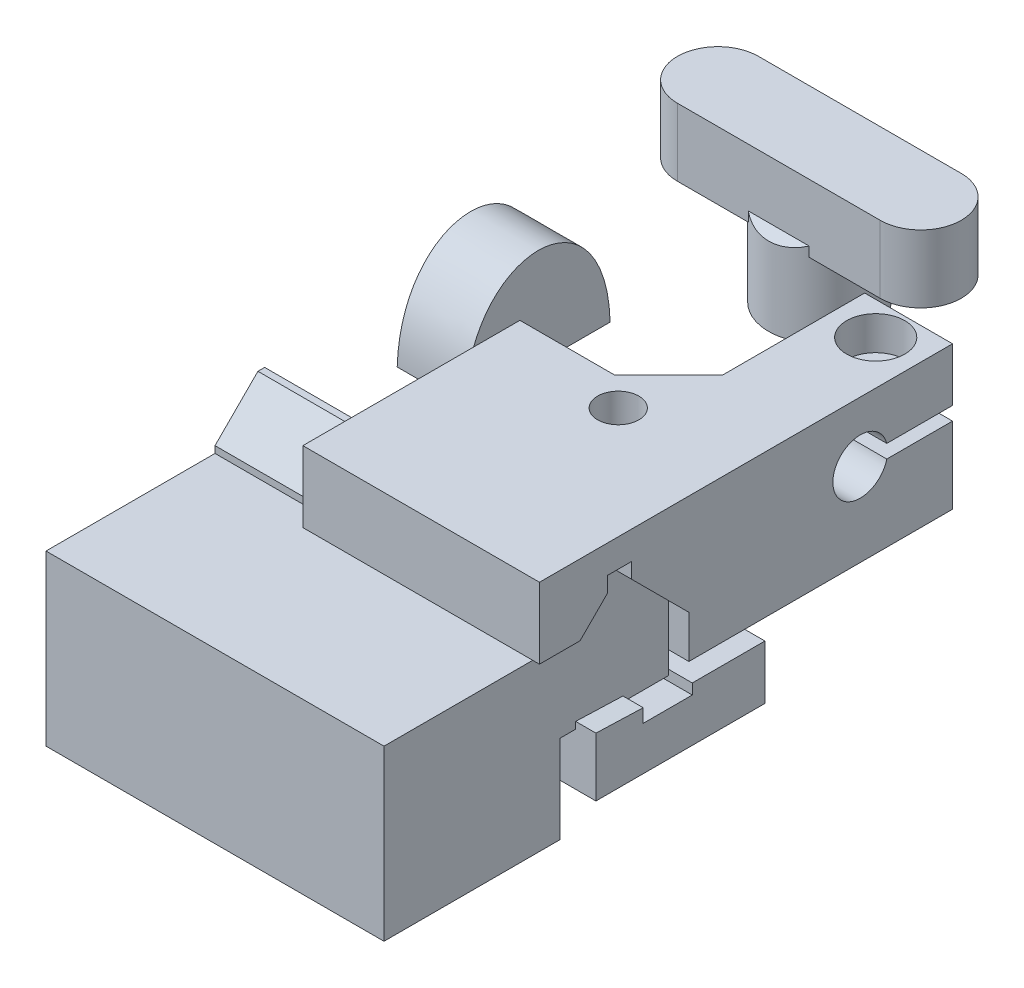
ISO-10303-21;
HEADER;
FILE_DESCRIPTION(('STEP AP214'),'2;1');
FILE_NAME('part.step','',(''),(''),'','','');
FILE_SCHEMA(('AUTOMOTIVE_DESIGN { 1 0 10303 214 1 1 1 1 }'));
ENDSEC;
DATA;
#1=APPLICATION_CONTEXT('core data for automotive mechanical design processes');
#2=APPLICATION_PROTOCOL_DEFINITION('international standard','automotive_design',2000,#1);
#3=PRODUCT_CONTEXT('',#1,'mechanical');
#4=PRODUCT('Part','Part','',(#3));
#5=PRODUCT_RELATED_PRODUCT_CATEGORY('part','',(#4));
#6=PRODUCT_DEFINITION_FORMATION('','',#4);
#7=PRODUCT_DEFINITION_CONTEXT('part definition',#1,'design');
#8=PRODUCT_DEFINITION('design','',#6,#7);
#9=PRODUCT_DEFINITION_SHAPE('','',#8);
#10=(LENGTH_UNIT() NAMED_UNIT(*) SI_UNIT(.MILLI.,.METRE.));
#11=(NAMED_UNIT(*) PLANE_ANGLE_UNIT() SI_UNIT($,.RADIAN.));
#12=(NAMED_UNIT(*) SI_UNIT($,.STERADIAN.) SOLID_ANGLE_UNIT());
#13=UNCERTAINTY_MEASURE_WITH_UNIT(LENGTH_MEASURE(1.E-05),#10,'distance_accuracy_value','');
#14=(GEOMETRIC_REPRESENTATION_CONTEXT(3) GLOBAL_UNCERTAINTY_ASSIGNED_CONTEXT((#13)) GLOBAL_UNIT_ASSIGNED_CONTEXT((#10,
#11,#12)) REPRESENTATION_CONTEXT('',''));
#15=CARTESIAN_POINT('',(0.,0.,0.));
#16=DIRECTION('',(0.,0.,1.));
#17=DIRECTION('',(1.,0.,0.));
#18=AXIS2_PLACEMENT_3D('',#15,#16,#17);
#19=CARTESIAN_POINT('',(3.82775940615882,6.,-88.0725530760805));
#20=DIRECTION('',(0.,-1.,0.));
#21=DIRECTION('',(0.,0.,-1.));
#22=AXIS2_PLACEMENT_3D('',#19,#20,#21);
#23=CYLINDRICAL_SURFACE('',#22,4.95);
#24=CARTESIAN_POINT('',(3.82775940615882,4.,-88.0725530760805));
#25=DIRECTION('',(0.,-1.,0.));
#26=DIRECTION('',(0.,0.,-1.));
#27=AXIS2_PLACEMENT_3D('',#24,#25,#26);
#28=CIRCLE('',#27,4.95);
#29=CARTESIAN_POINT('',(3.82775940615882,4.,-93.0225530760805));
#30=VERTEX_POINT('',#29);
#31=EDGE_CURVE('E268',#30,#30,#28,.T.);
#32=ORIENTED_EDGE('',*,*,#31,.F.);
#33=EDGE_LOOP('',(#32));
#34=FACE_BOUND('',#33,.T.);
#35=CARTESIAN_POINT('',(3.82775940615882,1.,-88.0725530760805));
#36=DIRECTION('',(0.,-1.,0.));
#37=DIRECTION('',(0.,0.,-1.));
#38=AXIS2_PLACEMENT_3D('',#35,#36,#37);
#39=CIRCLE('',#38,4.94999999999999);
#40=CARTESIAN_POINT('',(3.82775940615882,1.,-93.0225530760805));
#41=VERTEX_POINT('',#40);
#42=EDGE_CURVE('E322',#41,#41,#39,.T.);
#43=ORIENTED_EDGE('',*,*,#42,.T.);
#44=EDGE_LOOP('',(#43));
#45=FACE_BOUND('',#44,.T.);
#46=ADVANCED_FACE('F77',(#34,#45),#23,.F.);
#47=CARTESIAN_POINT('',(3.82775940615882,1.,-88.0725530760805));
#48=DIRECTION('',(0.,-1.,0.));
#49=DIRECTION('',(0.,0.,-1.));
#50=AXIS2_PLACEMENT_3D('',#47,#48,#49);
#51=PLANE('',#50);
#52=ORIENTED_EDGE('',*,*,#42,.F.);
#53=EDGE_LOOP('',(#52));
#54=FACE_BOUND('',#53,.T.);
#55=CARTESIAN_POINT('',(3.82775940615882,1.,-88.0725530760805));
#56=DIRECTION('',(0.,-1.,0.));
#57=DIRECTION('',(0.,0.,-1.));
#58=AXIS2_PLACEMENT_3D('',#55,#56,#57);
#59=CIRCLE('',#58,7.50000000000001);
#60=CARTESIAN_POINT('',(3.82775940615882,1.,-95.5725530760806));
#61=VERTEX_POINT('',#60);
#62=EDGE_CURVE('E325',#61,#61,#59,.T.);
#63=ORIENTED_EDGE('',*,*,#62,.T.);
#64=EDGE_LOOP('',(#63));
#65=FACE_BOUND('',#64,.T.);
#66=ADVANCED_FACE('F393',(#54,#65),#51,.T.);
#67=CARTESIAN_POINT('',(-11.1722405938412,22.,-88.0725530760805));
#68=DIRECTION('',(0.,-1.,0.));
#69=DIRECTION('',(0.,0.,-1.));
#70=AXIS2_PLACEMENT_3D('',#67,#68,#69);
#71=CYLINDRICAL_SURFACE('',#70,6.00000000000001);
#72=CARTESIAN_POINT('',(-11.1722405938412,12.,-88.0725530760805));
#73=DIRECTION('',(0.,1.,0.));
#74=DIRECTION('',(0.,0.,1.));
#75=AXIS2_PLACEMENT_3D('',#72,#73,#74);
#76=CIRCLE('',#75,6.00000000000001);
#77=CARTESIAN_POINT('',(-11.1722405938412,12.,-94.0725530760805));
#78=VERTEX_POINT('',#77);
#79=CARTESIAN_POINT('',(-11.1722405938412,12.,-82.0725530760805));
#80=VERTEX_POINT('',#79);
#81=EDGE_CURVE('E346',#78,#80,#76,.T.);
#82=ORIENTED_EDGE('',*,*,#81,.T.);
#83=DIRECTION('',(0.,-1.,0.));
#84=VECTOR('',#83,1.);
#85=CARTESIAN_POINT('',(-11.1722405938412,22.,-82.0725530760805));
#86=LINE('',#85,#84);
#87=CARTESIAN_POINT('',(-11.1722405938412,22.,-82.0725530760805));
#88=VERTEX_POINT('',#87);
#89=EDGE_CURVE('E353',#88,#80,#86,.T.);
#90=ORIENTED_EDGE('',*,*,#89,.F.);
#91=CARTESIAN_POINT('',(-11.1722405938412,22.,-88.0725530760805));
#92=DIRECTION('',(0.,1.,0.));
#93=DIRECTION('',(0.,0.,1.));
#94=AXIS2_PLACEMENT_3D('',#91,#92,#93);
#95=CIRCLE('',#94,6.00000000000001);
#96=CARTESIAN_POINT('',(-11.1722405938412,22.,-94.0725530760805));
#97=VERTEX_POINT('',#96);
#98=EDGE_CURVE('E335',#97,#88,#95,.T.);
#99=ORIENTED_EDGE('',*,*,#98,.F.);
#100=DIRECTION('',(0.,-1.,0.));
#101=VECTOR('',#100,1.);
#102=CARTESIAN_POINT('',(-11.1722405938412,22.,-94.0725530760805));
#103=LINE('',#102,#101);
#104=EDGE_CURVE('E356',#97,#78,#103,.T.);
#105=ORIENTED_EDGE('',*,*,#104,.T.);
#106=EDGE_LOOP('',(#82,#90,#99,#105));
#107=FACE_BOUND('',#106,.T.);
#108=ADVANCED_FACE('F399',(#107),#71,.T.);
#109=CARTESIAN_POINT('',(18.8277594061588,22.,-88.0725530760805));
#110=DIRECTION('',(0.,1.,0.));
#111=DIRECTION('',(0.,0.,1.));
#112=AXIS2_PLACEMENT_3D('',#109,#110,#111);
#113=PLANE('',#112);
#114=CARTESIAN_POINT('',(18.8277594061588,22.,-88.0725530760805));
#115=DIRECTION('',(0.,1.,0.));
#116=DIRECTION('',(0.,0.,1.));
#117=AXIS2_PLACEMENT_3D('',#114,#115,#116);
#118=CIRCLE('',#117,6.00000000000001);
#119=CARTESIAN_POINT('',(18.8277594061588,22.,-82.0725530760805));
#120=VERTEX_POINT('',#119);
#121=CARTESIAN_POINT('',(18.8277594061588,22.,-94.0725530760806));
#122=VERTEX_POINT('',#121);
#123=EDGE_CURVE('E329',#120,#122,#118,.T.);
#124=ORIENTED_EDGE('',*,*,#123,.T.);
#125=DIRECTION('',(-1.,0.,0.));
#126=VECTOR('',#125,1.);
#127=CARTESIAN_POINT('',(18.8277594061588,22.,-94.0725530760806));
#128=LINE('',#127,#126);
#129=EDGE_CURVE('E332',#122,#97,#128,.T.);
#130=ORIENTED_EDGE('',*,*,#129,.T.);
#131=ORIENTED_EDGE('',*,*,#98,.T.);
#132=DIRECTION('',(1.,0.,0.));
#133=VECTOR('',#132,1.);
#134=CARTESIAN_POINT('',(18.8277594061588,22.,-82.0725530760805));
#135=LINE('',#134,#133);
#136=EDGE_CURVE('E337',#88,#120,#135,.T.);
#137=ORIENTED_EDGE('',*,*,#136,.T.);
#138=EDGE_LOOP('',(#124,#130,#131,#137));
#139=FACE_BOUND('',#138,.T.);
#140=ADVANCED_FACE('F605',(#139),#113,.T.);
#141=CARTESIAN_POINT('',(18.8277594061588,22.,-88.0725530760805));
#142=DIRECTION('',(0.,-1.,0.));
#143=DIRECTION('',(0.,0.,-1.));
#144=AXIS2_PLACEMENT_3D('',#141,#142,#143);
#145=CYLINDRICAL_SURFACE('',#144,6.00000000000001);
#146=CARTESIAN_POINT('',(18.8277594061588,12.,-88.0725530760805));
#147=DIRECTION('',(0.,1.,0.));
#148=DIRECTION('',(0.,0.,1.));
#149=AXIS2_PLACEMENT_3D('',#146,#147,#148);
#150=CIRCLE('',#149,6.00000000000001);
#151=CARTESIAN_POINT('',(18.8277594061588,12.,-82.0725530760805));
#152=VERTEX_POINT('',#151);
#153=CARTESIAN_POINT('',(18.8277594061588,12.,-94.0725530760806));
#154=VERTEX_POINT('',#153);
#155=EDGE_CURVE('E328',#152,#154,#150,.T.);
#156=ORIENTED_EDGE('',*,*,#155,.T.);
#157=DIRECTION('',(0.,-1.,0.));
#158=VECTOR('',#157,1.);
#159=CARTESIAN_POINT('',(18.8277594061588,22.,-94.0725530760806));
#160=LINE('',#159,#158);
#161=EDGE_CURVE('E359',#122,#154,#160,.T.);
#162=ORIENTED_EDGE('',*,*,#161,.F.);
#163=ORIENTED_EDGE('',*,*,#123,.F.);
#164=DIRECTION('',(0.,-1.,0.));
#165=VECTOR('',#164,1.);
#166=CARTESIAN_POINT('',(18.8277594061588,22.,-82.0725530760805));
#167=LINE('',#166,#165);
#168=EDGE_CURVE('E339',#120,#152,#167,.T.);
#169=ORIENTED_EDGE('',*,*,#168,.T.);
#170=EDGE_LOOP('',(#156,#162,#163,#169));
#171=FACE_BOUND('',#170,.T.);
#172=ADVANCED_FACE('F582',(#171),#145,.T.);
#173=CARTESIAN_POINT('',(3.82775940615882,12.,-88.0725530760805));
#174=DIRECTION('',(0.,1.,0.));
#175=DIRECTION('',(0.,0.,1.));
#176=AXIS2_PLACEMENT_3D('',#173,#174,#175);
#177=PLANE('',#176);
#178=CARTESIAN_POINT('',(3.82775940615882,12.,-88.0725530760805));
#179=DIRECTION('',(0.,1.,0.));
#180=DIRECTION('',(0.,0.,1.));
#181=AXIS2_PLACEMENT_3D('',#178,#179,#180);
#182=CIRCLE('',#181,7.50000000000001);
#183=CARTESIAN_POINT('',(4.74762819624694,12.,-95.5159287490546));
#184=VERTEX_POINT('',#183);
#185=CARTESIAN_POINT('',(2.90789061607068,12.,-95.5159287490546));
#186=VERTEX_POINT('',#185);
#187=EDGE_CURVE('E244',#184,#186,#182,.T.);
#188=ORIENTED_EDGE('',*,*,#187,.T.);
#189=DIRECTION('',(1.,0.,0.));
#190=VECTOR('',#189,1.);
#191=CARTESIAN_POINT('',(3.82775940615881,12.,-95.5159287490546));
#192=LINE('',#191,#190);
#193=EDGE_CURVE('E252',#186,#184,#192,.T.);
#194=ORIENTED_EDGE('',*,*,#193,.T.);
#195=EDGE_LOOP('',(#188,#194));
#196=FACE_BOUND('',#195,.T.);
#197=ADVANCED_FACE('F416',(#196),#177,.T.);
#198=CARTESIAN_POINT('',(18.8277594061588,14.5,-94.0725530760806));
#199=DIRECTION('',(0.,-0.500000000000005,0.866025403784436));
#200=DIRECTION('',(-1.,0.,0.));
#201=AXIS2_PLACEMENT_3D('',#198,#199,#200);
#202=PLANE('',#201);
#203=CARTESIAN_POINT('',(3.82775940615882,24.8923048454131,-88.0725530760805));
#204=DIRECTION('',(0.,-0.500000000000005,0.866025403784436));
#205=DIRECTION('',(0.,-0.866025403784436,-0.500000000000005));
#206=AXIS2_PLACEMENT_3D('',#203,#204,#205);
#207=ELLIPSE('',#206,14.9999999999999,7.5);
#208=CARTESIAN_POINT('',(8.32775940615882,14.5,-94.0725530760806));
#209=VERTEX_POINT('',#208);
#210=EDGE_CURVE('E264',#184,#209,#207,.T.);
#211=ORIENTED_EDGE('',*,*,#210,.F.);
#212=ORIENTED_EDGE('',*,*,#193,.F.);
#213=CARTESIAN_POINT('',(3.82775940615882,24.8923048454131,-88.0725530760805));
#214=DIRECTION('',(0.,-0.500000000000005,0.866025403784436));
#215=DIRECTION('',(0.,-0.866025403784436,-0.500000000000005));
#216=AXIS2_PLACEMENT_3D('',#213,#214,#215);
#217=ELLIPSE('',#216,14.9999999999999,7.5);
#218=CARTESIAN_POINT('',(-0.672240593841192,14.5,-94.0725530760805));
#219=VERTEX_POINT('',#218);
#220=EDGE_CURVE('E262',#219,#186,#217,.T.);
#221=ORIENTED_EDGE('',*,*,#220,.F.);
#222=DIRECTION('',(-1.,0.,0.));
#223=VECTOR('',#222,1.);
#224=CARTESIAN_POINT('',(18.8277594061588,14.5,-94.0725530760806));
#225=LINE('',#224,#223);
#226=EDGE_CURVE('E247',#209,#219,#225,.T.);
#227=ORIENTED_EDGE('',*,*,#226,.F.);
#228=EDGE_LOOP('',(#211,#212,#221,#227));
#229=FACE_BOUND('',#228,.T.);
#230=ADVANCED_FACE('F409',(#229),#202,.F.);
#231=CARTESIAN_POINT('',(18.8277594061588,22.,-94.0725530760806));
#232=DIRECTION('',(0.,0.,1.));
#233=DIRECTION('',(1.,0.,0.));
#234=AXIS2_PLACEMENT_3D('',#231,#232,#233);
#235=PLANE('',#234);
#236=ORIENTED_EDGE('',*,*,#226,.T.);
#237=DIRECTION('',(0.,-1.,0.));
#238=VECTOR('',#237,1.);
#239=CARTESIAN_POINT('',(-0.672240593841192,14.5,-94.0725530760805));
#240=LINE('',#239,#238);
#241=CARTESIAN_POINT('',(-0.672240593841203,12.,-94.0725530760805));
#242=VERTEX_POINT('',#241);
#243=EDGE_CURVE('E250',#219,#242,#240,.T.);
#244=ORIENTED_EDGE('',*,*,#243,.T.);
#245=DIRECTION('',(-1.,0.,0.));
#246=VECTOR('',#245,1.);
#247=CARTESIAN_POINT('',(18.8277594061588,12.,-94.0725530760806));
#248=LINE('',#247,#246);
#249=EDGE_CURVE('E342',#242,#78,#248,.T.);
#250=ORIENTED_EDGE('',*,*,#249,.T.);
#251=ORIENTED_EDGE('',*,*,#104,.F.);
#252=ORIENTED_EDGE('',*,*,#129,.F.);
#253=ORIENTED_EDGE('',*,*,#161,.T.);
#254=CARTESIAN_POINT('',(8.32775940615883,12.,-94.0725530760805));
#255=VERTEX_POINT('',#254);
#256=EDGE_CURVE('E343',#154,#255,#248,.T.);
#257=ORIENTED_EDGE('',*,*,#256,.T.);
#258=DIRECTION('',(0.,-1.,0.));
#259=VECTOR('',#258,1.);
#260=CARTESIAN_POINT('',(8.32775940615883,12.,-94.0725530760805));
#261=LINE('',#260,#259);
#262=EDGE_CURVE('E243',#255,#209,#261,.F.);
#263=ORIENTED_EDGE('',*,*,#262,.T.);
#264=EDGE_LOOP('',(#236,#244,#250,#251,#252,#253,#257,#263));
#265=FACE_BOUND('',#264,.T.);
#266=ADVANCED_FACE('F415',(#265),#235,.F.);
#267=CARTESIAN_POINT('',(18.8277594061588,12.,-88.0725530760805));
#268=DIRECTION('',(0.,1.,0.));
#269=DIRECTION('',(0.,0.,1.));
#270=AXIS2_PLACEMENT_3D('',#267,#268,#269);
#271=PLANE('',#270);
#272=ORIENTED_EDGE('',*,*,#249,.F.);
#273=CARTESIAN_POINT('',(-0.67224059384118,12.,-82.0725530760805));
#274=VERTEX_POINT('',#273);
#275=EDGE_CURVE('E239',#242,#274,#182,.T.);
#276=ORIENTED_EDGE('',*,*,#275,.T.);
#277=DIRECTION('',(1.,0.,0.));
#278=VECTOR('',#277,1.);
#279=CARTESIAN_POINT('',(18.8277594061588,12.,-82.0725530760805));
#280=LINE('',#279,#278);
#281=EDGE_CURVE('E333',#80,#274,#280,.T.);
#282=ORIENTED_EDGE('',*,*,#281,.F.);
#283=ORIENTED_EDGE('',*,*,#81,.F.);
#284=EDGE_LOOP('',(#272,#276,#282,#283));
#285=FACE_BOUND('',#284,.T.);
#286=ADVANCED_FACE('F424',(#285),#271,.F.);
#287=CARTESIAN_POINT('',(18.8277594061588,13.4433756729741,-82.0725530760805));
#288=DIRECTION('',(0.,-0.866025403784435,-0.500000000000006));
#289=DIRECTION('',(1.,0.,0.));
#290=AXIS2_PLACEMENT_3D('',#287,#288,#289);
#291=PLANE('',#290);
#292=DIRECTION('',(1.,0.,0.));
#293=VECTOR('',#292,1.);
#294=CARTESIAN_POINT('',(18.8277594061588,13.4433756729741,-82.0725530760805));
#295=LINE('',#294,#293);
#296=CARTESIAN_POINT('',(-0.672240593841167,13.4433756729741,-82.0725530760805));
#297=VERTEX_POINT('',#296);
#298=CARTESIAN_POINT('',(8.32775940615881,13.4433756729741,-82.0725530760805));
#299=VERTEX_POINT('',#298);
#300=EDGE_CURVE('E257',#297,#299,#295,.T.);
#301=ORIENTED_EDGE('',*,*,#300,.F.);
#302=CARTESIAN_POINT('',(3.82775940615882,16.9074772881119,-88.0725530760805));
#303=DIRECTION('',(0.,-0.866025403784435,-0.500000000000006));
#304=DIRECTION('',(0.,-0.500000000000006,0.866025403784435));
#305=AXIS2_PLACEMENT_3D('',#302,#303,#304);
#306=ELLIPSE('',#305,8.66025403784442,7.5);
#307=EDGE_CURVE('E266',#299,#297,#306,.T.);
#308=ORIENTED_EDGE('',*,*,#307,.F.);
#309=EDGE_LOOP('',(#301,#308));
#310=FACE_BOUND('',#309,.T.);
#311=ADVANCED_FACE('F418',(#310),#291,.F.);
#312=CARTESIAN_POINT('',(18.8277594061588,22.,-82.0725530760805));
#313=DIRECTION('',(0.,0.,-1.));
#314=DIRECTION('',(-1.,0.,0.));
#315=AXIS2_PLACEMENT_3D('',#312,#313,#314);
#316=PLANE('',#315);
#317=ORIENTED_EDGE('',*,*,#300,.T.);
#318=DIRECTION('',(0.,-1.,0.));
#319=VECTOR('',#318,1.);
#320=CARTESIAN_POINT('',(8.32775940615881,13.4433756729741,-82.0725530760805));
#321=LINE('',#320,#319);
#322=CARTESIAN_POINT('',(8.32775940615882,12.,-82.0725530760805));
#323=VERTEX_POINT('',#322);
#324=EDGE_CURVE('E260',#299,#323,#321,.T.);
#325=ORIENTED_EDGE('',*,*,#324,.T.);
#326=EDGE_CURVE('E348',#323,#152,#280,.T.);
#327=ORIENTED_EDGE('',*,*,#326,.T.);
#328=ORIENTED_EDGE('',*,*,#168,.F.);
#329=ORIENTED_EDGE('',*,*,#136,.F.);
#330=ORIENTED_EDGE('',*,*,#89,.T.);
#331=ORIENTED_EDGE('',*,*,#281,.T.);
#332=DIRECTION('',(0.,-1.,0.));
#333=VECTOR('',#332,1.);
#334=CARTESIAN_POINT('',(-0.67224059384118,12.,-82.0725530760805));
#335=LINE('',#334,#333);
#336=EDGE_CURVE('E254',#274,#297,#335,.F.);
#337=ORIENTED_EDGE('',*,*,#336,.T.);
#338=EDGE_LOOP('',(#317,#325,#327,#328,#329,#330,#331,#337));
#339=FACE_BOUND('',#338,.T.);
#340=ADVANCED_FACE('F423',(#339),#316,.F.);
#341=ORIENTED_EDGE('',*,*,#326,.F.);
#342=EDGE_CURVE('E240',#323,#255,#182,.T.);
#343=ORIENTED_EDGE('',*,*,#342,.T.);
#344=ORIENTED_EDGE('',*,*,#256,.F.);
#345=ORIENTED_EDGE('',*,*,#155,.F.);
#346=EDGE_LOOP('',(#341,#343,#344,#345));
#347=FACE_BOUND('',#346,.T.);
#348=ADVANCED_FACE('F506',(#347),#271,.F.);
#349=CARTESIAN_POINT('',(3.82775940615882,6.,-88.0725530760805));
#350=DIRECTION('',(0.,-1.,0.));
#351=DIRECTION('',(0.,0.,-1.));
#352=AXIS2_PLACEMENT_3D('',#349,#350,#351);
#353=CYLINDRICAL_SURFACE('',#352,7.5);
#354=ORIENTED_EDGE('',*,*,#342,.F.);
#355=ORIENTED_EDGE('',*,*,#324,.F.);
#356=ORIENTED_EDGE('',*,*,#307,.T.);
#357=ORIENTED_EDGE('',*,*,#336,.F.);
#358=ORIENTED_EDGE('',*,*,#275,.F.);
#359=ORIENTED_EDGE('',*,*,#243,.F.);
#360=ORIENTED_EDGE('',*,*,#220,.T.);
#361=ORIENTED_EDGE('',*,*,#187,.F.);
#362=ORIENTED_EDGE('',*,*,#210,.T.);
#363=ORIENTED_EDGE('',*,*,#262,.F.);
#364=EDGE_LOOP('',(#354,#355,#356,#357,#358,#359,#360,#361,#362,#363));
#365=FACE_BOUND('',#364,.T.);
#366=ORIENTED_EDGE('',*,*,#62,.F.);
#367=EDGE_LOOP('',(#366));
#368=FACE_BOUND('',#367,.T.);
#369=ADVANCED_FACE('F406',(#365,#368),#353,.T.);
#370=CARTESIAN_POINT('',(3.82775940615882,4.,-88.0725530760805));
#371=DIRECTION('',(0.,-1.,0.));
#372=DIRECTION('',(0.,0.,-1.));
#373=AXIS2_PLACEMENT_3D('',#370,#371,#372);
#374=PLANE('',#373);
#375=ORIENTED_EDGE('',*,*,#31,.T.);
#376=EDGE_LOOP('',(#375));
#377=FACE_BOUND('',#376,.T.);
#378=DIRECTION('',(-0.500000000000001,0.,0.866025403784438));
#379=VECTOR('',#378,1.);
#380=CARTESIAN_POINT('',(6.59904069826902,4.,-88.0725530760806));
#381=LINE('',#380,#379);
#382=CARTESIAN_POINT('',(6.59904069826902,4.,-88.0725530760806));
#383=VERTEX_POINT('',#382);
#384=CARTESIAN_POINT('',(5.21340005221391,4.,-85.6725530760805));
#385=VERTEX_POINT('',#384);
#386=EDGE_CURVE('E208',#383,#385,#381,.T.);
#387=ORIENTED_EDGE('',*,*,#386,.F.);
#388=DIRECTION('',(0.500000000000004,0.,0.866025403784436));
#389=VECTOR('',#388,1.);
#390=CARTESIAN_POINT('',(5.2134000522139,4.,-90.4725530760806));
#391=LINE('',#390,#389);
#392=CARTESIAN_POINT('',(5.2134000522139,4.,-90.4725530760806));
#393=VERTEX_POINT('',#392);
#394=EDGE_CURVE('E224',#393,#383,#391,.T.);
#395=ORIENTED_EDGE('',*,*,#394,.F.);
#396=DIRECTION('',(1.,0.,0.));
#397=VECTOR('',#396,1.);
#398=CARTESIAN_POINT('',(2.4421187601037,4.,-90.4725530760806));
#399=LINE('',#398,#397);
#400=CARTESIAN_POINT('',(2.4421187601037,4.,-90.4725530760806));
#401=VERTEX_POINT('',#400);
#402=EDGE_CURVE('E319',#401,#393,#399,.T.);
#403=ORIENTED_EDGE('',*,*,#402,.F.);
#404=DIRECTION('',(0.499999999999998,0.,-0.86602540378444));
#405=VECTOR('',#404,1.);
#406=CARTESIAN_POINT('',(1.05647811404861,4.,-88.0725530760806));
#407=LINE('',#406,#405);
#408=CARTESIAN_POINT('',(1.05647811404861,4.,-88.0725530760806));
#409=VERTEX_POINT('',#408);
#410=EDGE_CURVE('E316',#409,#401,#407,.T.);
#411=ORIENTED_EDGE('',*,*,#410,.F.);
#412=DIRECTION('',(-0.499999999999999,0.,-0.866025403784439));
#413=VECTOR('',#412,1.);
#414=CARTESIAN_POINT('',(2.44211876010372,4.,-85.6725530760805));
#415=LINE('',#414,#413);
#416=CARTESIAN_POINT('',(2.44211876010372,4.,-85.6725530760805));
#417=VERTEX_POINT('',#416);
#418=EDGE_CURVE('E211',#417,#409,#415,.T.);
#419=ORIENTED_EDGE('',*,*,#418,.F.);
#420=DIRECTION('',(-1.,0.,0.));
#421=VECTOR('',#420,1.);
#422=CARTESIAN_POINT('',(5.21340005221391,4.,-85.6725530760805));
#423=LINE('',#422,#421);
#424=EDGE_CURVE('E205',#385,#417,#423,.T.);
#425=ORIENTED_EDGE('',*,*,#424,.F.);
#426=EDGE_LOOP('',(#387,#395,#403,#411,#419,#425));
#427=FACE_BOUND('',#426,.T.);
#428=ADVANCED_FACE('F207',(#377,#427),#374,.T.);
#429=CARTESIAN_POINT('',(0.,0.,0.));
#430=DIRECTION('',(0.,1.,0.));
#431=DIRECTION('',(0.,0.,1.));
#432=AXIS2_PLACEMENT_3D('',#429,#430,#431);
#433=PLANE('',#432);
#434=DIRECTION('',(0.5,0.,0.866025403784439));
#435=VECTOR('',#434,1.);
#436=CARTESIAN_POINT('',(42.2197892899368,0.,-24.3756067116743));
#437=LINE('',#436,#435);
#438=CARTESIAN_POINT('',(4.63604978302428,0.,-89.4725530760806));
#439=VERTEX_POINT('',#438);
#440=CARTESIAN_POINT('',(5.44434015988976,0.,-88.0725530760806));
#441=VERTEX_POINT('',#440);
#442=EDGE_CURVE('E281',#439,#441,#437,.T.);
#443=ORIENTED_EDGE('',*,*,#442,.T.);
#444=DIRECTION('',(-0.5,0.,0.866025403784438));
#445=VECTOR('',#444,1.);
#446=CARTESIAN_POINT('',(-34.0532790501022,0.,-19.660669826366));
#447=LINE('',#446,#445);
#448=CARTESIAN_POINT('',(4.63604978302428,0.,-86.6725530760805));
#449=VERTEX_POINT('',#448);
#450=EDGE_CURVE('E283',#441,#449,#447,.T.);
#451=ORIENTED_EDGE('',*,*,#450,.T.);
#452=DIRECTION('',(-1.,0.,0.));
#453=VECTOR('',#452,1.);
#454=CARTESIAN_POINT('',(0.,0.,-86.6725530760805));
#455=LINE('',#454,#453);
#456=CARTESIAN_POINT('',(3.01946902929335,0.,-86.6725530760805));
#457=VERTEX_POINT('',#456);
#458=EDGE_CURVE('E273',#449,#457,#455,.T.);
#459=ORIENTED_EDGE('',*,*,#458,.T.);
#460=DIRECTION('',(-0.499999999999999,0.,-0.866025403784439));
#461=VECTOR('',#460,1.);
#462=CARTESIAN_POINT('',(39.7949181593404,0.,-22.9756067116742));
#463=LINE('',#462,#461);
#464=CARTESIAN_POINT('',(2.21117865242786,0.,-88.0725530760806));
#465=VERTEX_POINT('',#464);
#466=EDGE_CURVE('E275',#457,#465,#463,.T.);
#467=ORIENTED_EDGE('',*,*,#466,.T.);
#468=DIRECTION('',(0.500000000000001,0.,-0.866025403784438));
#469=VECTOR('',#468,1.);
#470=CARTESIAN_POINT('',(-36.4781501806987,0.,-21.060669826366));
#471=LINE('',#470,#469);
#472=CARTESIAN_POINT('',(3.01946902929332,0.,-89.4725530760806));
#473=VERTEX_POINT('',#472);
#474=EDGE_CURVE('E277',#465,#473,#471,.T.);
#475=ORIENTED_EDGE('',*,*,#474,.T.);
#476=DIRECTION('',(1.,0.,0.));
#477=VECTOR('',#476,1.);
#478=CARTESIAN_POINT('',(0.,0.,-89.4725530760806));
#479=LINE('',#478,#477);
#480=EDGE_CURVE('E279',#473,#439,#479,.T.);
#481=ORIENTED_EDGE('',*,*,#480,.T.);
#482=EDGE_LOOP('',(#443,#451,#459,#467,#475,#481));
#483=FACE_BOUND('',#482,.T.);
#484=ADVANCED_FACE('F374',(#483),#433,.F.);
#485=CARTESIAN_POINT('',(43.0858146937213,6.,-24.8756067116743));
#486=DIRECTION('',(-0.866025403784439,0.,0.5));
#487=DIRECTION('',(0.5,0.,0.866025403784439));
#488=AXIS2_PLACEMENT_3D('',#485,#486,#487);
#489=PLANE('',#488);
#490=DIRECTION('',(0.,-1.,0.));
#491=VECTOR('',#490,1.);
#492=CARTESIAN_POINT('',(6.59904069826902,6.,-88.0725530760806));
#493=LINE('',#492,#491);
#494=CARTESIAN_POINT('',(6.59904069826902,0.999999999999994,-88.0725530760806));
#495=VERTEX_POINT('',#494);
#496=EDGE_CURVE('E223',#383,#495,#493,.T.);
#497=ORIENTED_EDGE('',*,*,#496,.T.);
#498=DIRECTION('',(-0.5,0.,-0.866025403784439));
#499=VECTOR('',#498,1.);
#500=CARTESIAN_POINT('',(43.0858146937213,0.999999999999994,-24.8756067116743));
#501=LINE('',#500,#499);
#502=CARTESIAN_POINT('',(5.21340005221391,0.999999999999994,-90.4725530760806));
#503=VERTEX_POINT('',#502);
#504=EDGE_CURVE('E286',#495,#503,#501,.T.);
#505=ORIENTED_EDGE('',*,*,#504,.T.);
#506=DIRECTION('',(0.,-1.,0.));
#507=VECTOR('',#506,1.);
#508=CARTESIAN_POINT('',(5.21340005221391,6.,-90.4725530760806));
#509=LINE('',#508,#507);
#510=EDGE_CURVE('E232',#393,#503,#509,.T.);
#511=ORIENTED_EDGE('',*,*,#510,.F.);
#512=ORIENTED_EDGE('',*,*,#394,.T.);
#513=EDGE_LOOP('',(#497,#505,#511,#512));
#514=FACE_BOUND('',#513,.T.);
#515=ADVANCED_FACE('F521',(#514),#489,.F.);
#516=CARTESIAN_POINT('',(-33.1872536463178,6.,-19.160669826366));
#517=DIRECTION('',(-0.866025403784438,0.,-0.5));
#518=DIRECTION('',(-0.5,0.,0.866025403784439));
#519=AXIS2_PLACEMENT_3D('',#516,#517,#518);
#520=PLANE('',#519);
#521=DIRECTION('',(0.,-1.,0.));
#522=VECTOR('',#521,1.);
#523=CARTESIAN_POINT('',(5.2134000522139,6.,-85.6725530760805));
#524=LINE('',#523,#522);
#525=CARTESIAN_POINT('',(5.2134000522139,0.999999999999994,-85.6725530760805));
#526=VERTEX_POINT('',#525);
#527=EDGE_CURVE('E220',#385,#526,#524,.T.);
#528=ORIENTED_EDGE('',*,*,#527,.T.);
#529=DIRECTION('',(0.5,0.,-0.866025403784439));
#530=VECTOR('',#529,1.);
#531=CARTESIAN_POINT('',(-33.1872536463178,0.999999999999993,-19.160669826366));
#532=LINE('',#531,#530);
#533=EDGE_CURVE('E271',#526,#495,#532,.T.);
#534=ORIENTED_EDGE('',*,*,#533,.T.);
#535=ORIENTED_EDGE('',*,*,#496,.F.);
#536=ORIENTED_EDGE('',*,*,#386,.T.);
#537=EDGE_LOOP('',(#528,#534,#535,#536));
#538=FACE_BOUND('',#537,.T.);
#539=ADVANCED_FACE('F218',(#538),#520,.F.);
#540=CARTESIAN_POINT('',(0.,6.,-85.6725530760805));
#541=DIRECTION('',(0.,0.,-1.));
#542=DIRECTION('',(-1.,0.,0.));
#543=AXIS2_PLACEMENT_3D('',#540,#541,#542);
#544=PLANE('',#543);
#545=DIRECTION('',(0.,-1.,0.));
#546=VECTOR('',#545,1.);
#547=CARTESIAN_POINT('',(2.44211876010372,6.,-85.6725530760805));
#548=LINE('',#547,#546);
#549=CARTESIAN_POINT('',(2.44211876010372,0.999999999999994,-85.6725530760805));
#550=VERTEX_POINT('',#549);
#551=EDGE_CURVE('E228',#417,#550,#548,.T.);
#552=ORIENTED_EDGE('',*,*,#551,.T.);
#553=DIRECTION('',(1.,0.,0.));
#554=VECTOR('',#553,1.);
#555=CARTESIAN_POINT('',(0.,0.999999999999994,-85.6725530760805));
#556=LINE('',#555,#554);
#557=EDGE_CURVE('E13',#550,#526,#556,.T.);
#558=ORIENTED_EDGE('',*,*,#557,.T.);
#559=ORIENTED_EDGE('',*,*,#527,.F.);
#560=ORIENTED_EDGE('',*,*,#424,.T.);
#561=EDGE_LOOP('',(#552,#558,#559,#560));
#562=FACE_BOUND('',#561,.T.);
#563=ADVANCED_FACE('F226',(#562),#544,.F.);
#564=CARTESIAN_POINT('',(38.9288927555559,6.,-22.4756067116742));
#565=DIRECTION('',(0.866025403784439,0.,-0.499999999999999));
#566=DIRECTION('',(-0.499999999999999,0.,-0.866025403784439));
#567=AXIS2_PLACEMENT_3D('',#564,#565,#566);
#568=PLANE('',#567);
#569=DIRECTION('',(0.,-1.,0.));
#570=VECTOR('',#569,1.);
#571=CARTESIAN_POINT('',(1.0564781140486,6.,-88.0725530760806));
#572=LINE('',#571,#570);
#573=CARTESIAN_POINT('',(1.0564781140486,0.999999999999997,-88.0725530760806));
#574=VERTEX_POINT('',#573);
#575=EDGE_CURVE('E230',#409,#574,#572,.T.);
#576=ORIENTED_EDGE('',*,*,#575,.T.);
#577=DIRECTION('',(0.499999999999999,0.,0.866025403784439));
#578=VECTOR('',#577,1.);
#579=CARTESIAN_POINT('',(38.9288927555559,0.999999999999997,-22.4756067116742));
#580=LINE('',#579,#578);
#581=EDGE_CURVE('E87',#574,#550,#580,.T.);
#582=ORIENTED_EDGE('',*,*,#581,.T.);
#583=ORIENTED_EDGE('',*,*,#551,.F.);
#584=ORIENTED_EDGE('',*,*,#418,.T.);
#585=EDGE_LOOP('',(#576,#582,#583,#584));
#586=FACE_BOUND('',#585,.T.);
#587=ADVANCED_FACE('F540',(#586),#568,.F.);
#588=CARTESIAN_POINT('',(-37.3441755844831,6.,-21.560669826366));
#589=DIRECTION('',(0.866025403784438,0.,0.500000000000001));
#590=DIRECTION('',(0.500000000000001,0.,-0.866025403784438));
#591=AXIS2_PLACEMENT_3D('',#588,#589,#590);
#592=PLANE('',#591);
#593=DIRECTION('',(0.,-1.,0.));
#594=VECTOR('',#593,1.);
#595=CARTESIAN_POINT('',(2.44211876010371,6.,-90.4725530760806));
#596=LINE('',#595,#594);
#597=CARTESIAN_POINT('',(2.44211876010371,0.999999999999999,-90.4725530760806));
#598=VERTEX_POINT('',#597);
#599=EDGE_CURVE('E237',#401,#598,#596,.T.);
#600=ORIENTED_EDGE('',*,*,#599,.T.);
#601=DIRECTION('',(-0.500000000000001,0.,0.866025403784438));
#602=VECTOR('',#601,1.);
#603=CARTESIAN_POINT('',(-37.3441755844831,0.999999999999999,-21.560669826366));
#604=LINE('',#603,#602);
#605=EDGE_CURVE('E102',#598,#574,#604,.T.);
#606=ORIENTED_EDGE('',*,*,#605,.T.);
#607=ORIENTED_EDGE('',*,*,#575,.F.);
#608=ORIENTED_EDGE('',*,*,#410,.T.);
#609=EDGE_LOOP('',(#600,#606,#607,#608));
#610=FACE_BOUND('',#609,.T.);
#611=ADVANCED_FACE('F547',(#610),#592,.F.);
#612=CARTESIAN_POINT('',(0.,6.,-90.4725530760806));
#613=DIRECTION('',(0.,0.,1.));
#614=DIRECTION('',(1.,0.,0.));
#615=AXIS2_PLACEMENT_3D('',#612,#613,#614);
#616=PLANE('',#615);
#617=ORIENTED_EDGE('',*,*,#510,.T.);
#618=DIRECTION('',(-1.,0.,0.));
#619=VECTOR('',#618,1.);
#620=CARTESIAN_POINT('',(0.,0.999999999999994,-90.4725530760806));
#621=LINE('',#620,#619);
#622=EDGE_CURVE('E288',#503,#598,#621,.T.);
#623=ORIENTED_EDGE('',*,*,#622,.T.);
#624=ORIENTED_EDGE('',*,*,#599,.F.);
#625=ORIENTED_EDGE('',*,*,#402,.T.);
#626=EDGE_LOOP('',(#617,#623,#624,#625));
#627=FACE_BOUND('',#626,.T.);
#628=ADVANCED_FACE('F363',(#627),#616,.F.);
#629=CARTESIAN_POINT('',(-37.3441755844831,0.999999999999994,-21.560669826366));
#630=DIRECTION('',(0.612372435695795,0.707106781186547,0.353553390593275));
#631=DIRECTION('',(-0.500000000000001,0.,0.866025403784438));
#632=AXIS2_PLACEMENT_3D('',#629,#630,#631);
#633=PLANE('',#632);
#634=DIRECTION('',(0.377964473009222,-0.654653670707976,0.654653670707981));
#635=VECTOR('',#634,1.);
#636=CARTESIAN_POINT('',(13.8096314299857,-18.6891094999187,-70.7834435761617));
#637=LINE('',#636,#635);
#638=EDGE_CURVE('E301',#473,#598,#637,.F.);
#639=ORIENTED_EDGE('',*,*,#638,.F.);
#640=ORIENTED_EDGE('',*,*,#474,.F.);
#641=DIRECTION('',(0.755928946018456,-0.654653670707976,0.));
#642=VECTOR('',#641,1.);
#643=CARTESIAN_POINT('',(22.6978579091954,-17.7419846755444,-88.0725530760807));
#644=LINE('',#643,#642);
#645=EDGE_CURVE('E82',#574,#465,#644,.T.);
#646=ORIENTED_EDGE('',*,*,#645,.F.);
#647=ORIENTED_EDGE('',*,*,#605,.F.);
#648=EDGE_LOOP('',(#639,#640,#646,#647));
#649=FACE_BOUND('',#648,.T.);
#650=ADVANCED_FACE('F80',(#649),#633,.F.);
#651=CARTESIAN_POINT('',(38.9288927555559,0.999999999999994,-22.4756067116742));
#652=DIRECTION('',(0.612372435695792,0.70710678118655,-0.353553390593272));
#653=DIRECTION('',(0.499999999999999,0.,0.866025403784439));
#654=AXIS2_PLACEMENT_3D('',#651,#652,#653);
#655=PLANE('',#654);
#656=ORIENTED_EDGE('',*,*,#645,.T.);
#657=ORIENTED_EDGE('',*,*,#466,.F.);
#658=DIRECTION('',(0.37796447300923,-0.654653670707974,-0.654653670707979));
#659=VECTOR('',#658,1.);
#660=CARTESIAN_POINT('',(2.09324465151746,1.60426768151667,-85.0682853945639));
#661=LINE('',#660,#659);
#662=EDGE_CURVE('E299',#550,#457,#661,.T.);
#663=ORIENTED_EDGE('',*,*,#662,.F.);
#664=ORIENTED_EDGE('',*,*,#581,.F.);
#665=EDGE_LOOP('',(#656,#657,#663,#664));
#666=FACE_BOUND('',#665,.T.);
#667=ADVANCED_FACE('F383',(#666),#655,.F.);
#668=CARTESIAN_POINT('',(0.,0.999999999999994,-90.4725530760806));
#669=DIRECTION('',(0.,0.70710678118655,0.707106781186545));
#670=DIRECTION('',(-1.,0.,0.));
#671=AXIS2_PLACEMENT_3D('',#668,#669,#670);
#672=PLANE('',#671);
#673=ORIENTED_EDGE('',*,*,#638,.T.);
#674=ORIENTED_EDGE('',*,*,#622,.F.);
#675=DIRECTION('',(-0.377964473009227,-0.654653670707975,0.65465367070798));
#676=VECTOR('',#675,1.);
#677=CARTESIAN_POINT('',(4.46862861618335,-0.28998196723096,-89.1825711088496));
#678=LINE('',#677,#676);
#679=EDGE_CURVE('E296',#439,#503,#678,.F.);
#680=ORIENTED_EDGE('',*,*,#679,.F.);
#681=ORIENTED_EDGE('',*,*,#480,.F.);
#682=EDGE_LOOP('',(#673,#674,#680,#681));
#683=FACE_BOUND('',#682,.T.);
#684=ADVANCED_FACE('F366',(#683),#672,.F.);
#685=CARTESIAN_POINT('',(0.,0.999999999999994,-85.6725530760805));
#686=DIRECTION('',(0.,0.70710678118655,-0.707106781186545));
#687=DIRECTION('',(1.,0.,0.));
#688=AXIS2_PLACEMENT_3D('',#685,#686,#687);
#689=PLANE('',#688);
#690=ORIENTED_EDGE('',*,*,#662,.T.);
#691=ORIENTED_EDGE('',*,*,#458,.F.);
#692=DIRECTION('',(0.37796447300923,0.654653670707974,0.654653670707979));
#693=VECTOR('',#692,1.);
#694=CARTESIAN_POINT('',(4.46862861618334,-0.289981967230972,-86.9625350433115));
#695=LINE('',#694,#693);
#696=EDGE_CURVE('E294',#526,#449,#695,.F.);
#697=ORIENTED_EDGE('',*,*,#696,.F.);
#698=ORIENTED_EDGE('',*,*,#557,.F.);
#699=EDGE_LOOP('',(#690,#691,#697,#698));
#700=FACE_BOUND('',#699,.T.);
#701=ADVANCED_FACE('F380',(#700),#689,.F.);
#702=CARTESIAN_POINT('',(43.0858146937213,0.999999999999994,-24.8756067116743));
#703=DIRECTION('',(-0.612372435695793,0.707106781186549,0.353553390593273));
#704=DIRECTION('',(-0.5,0.,-0.866025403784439));
#705=AXIS2_PLACEMENT_3D('',#702,#703,#704);
#706=PLANE('',#705);
#707=ORIENTED_EDGE('',*,*,#679,.T.);
#708=ORIENTED_EDGE('',*,*,#504,.F.);
#709=DIRECTION('',(-0.755928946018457,-0.654653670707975,0.));
#710=VECTOR('',#709,1.);
#711=CARTESIAN_POINT('',(27.4486258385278,19.0562703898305,-88.0725530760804));
#712=LINE('',#711,#710);
#713=EDGE_CURVE('E292',#441,#495,#712,.F.);
#714=ORIENTED_EDGE('',*,*,#713,.F.);
#715=ORIENTED_EDGE('',*,*,#442,.F.);
#716=EDGE_LOOP('',(#707,#708,#714,#715));
#717=FACE_BOUND('',#716,.T.);
#718=ADVANCED_FACE('F370',(#717),#706,.F.);
#719=CARTESIAN_POINT('',(-33.1872536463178,0.999999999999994,-19.160669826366));
#720=DIRECTION('',(-0.612372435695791,0.707106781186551,-0.353553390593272));
#721=DIRECTION('',(0.5,0.,-0.866025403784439));
#722=AXIS2_PLACEMENT_3D('',#719,#720,#721);
#723=PLANE('',#722);
#724=ORIENTED_EDGE('',*,*,#696,.T.);
#725=ORIENTED_EDGE('',*,*,#450,.F.);
#726=ORIENTED_EDGE('',*,*,#713,.T.);
#727=ORIENTED_EDGE('',*,*,#533,.F.);
#728=EDGE_LOOP('',(#724,#725,#726,#727));
#729=FACE_BOUND('',#728,.T.);
#730=ADVANCED_FACE('F376',(#729),#723,.F.);
#731=CLOSED_SHELL('',(#46,#66,#108,#140,#172,#197,#230,#266,#286,#311,#340,#348,#369,#428,#484,
#515,#539,#563,#587,#611,#628,#650,#667,#684,#701,#718,#730));
#732=MANIFOLD_SOLID_BREP('B2',#731);
#733=CARTESIAN_POINT('',(26.5,25.001,-35.6519335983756));
#734=DIRECTION('',(0.,-1.,0.));
#735=DIRECTION('',(0.,0.,-1.));
#736=AXIS2_PLACEMENT_3D('',#733,#734,#735);
#737=CYLINDRICAL_SURFACE('',#736,3.05000000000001);
#738=CARTESIAN_POINT('',(26.5,0.79583694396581,-35.6519335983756));
#739=DIRECTION('',(0.,1.,0.));
#740=DIRECTION('',(0.,0.,1.));
#741=AXIS2_PLACEMENT_3D('',#738,#739,#740);
#742=CIRCLE('',#741,3.05000000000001);
#743=CARTESIAN_POINT('',(26.5,0.795836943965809,-32.6019335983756));
#744=VERTEX_POINT('',#743);
#745=EDGE_CURVE('E805',#744,#744,#742,.F.);
#746=ORIENTED_EDGE('',*,*,#745,.F.);
#747=EDGE_LOOP('',(#746));
#748=FACE_BOUND('',#747,.T.);
#749=CARTESIAN_POINT('',(26.5,-1.50416305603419,-35.6519335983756));
#750=DIRECTION('',(0.,-1.,0.));
#751=DIRECTION('',(0.,0.,-1.));
#752=AXIS2_PLACEMENT_3D('',#749,#750,#751);
#753=CIRCLE('',#752,3.05000000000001);
#754=CARTESIAN_POINT('',(26.5,-1.50416305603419,-38.7019335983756));
#755=VERTEX_POINT('',#754);
#756=EDGE_CURVE('E75',#755,#755,#753,.F.);
#757=ORIENTED_EDGE('',*,*,#756,.F.);
#758=EDGE_LOOP('',(#757));
#759=FACE_BOUND('',#758,.T.);
#760=ADVANCED_FACE('F695',(#748,#759),#737,.F.);
#761=CARTESIAN_POINT('',(8.,0.,0.));
#762=DIRECTION('',(-1.,0.,0.));
#763=DIRECTION('',(0.,0.,1.));
#764=AXIS2_PLACEMENT_3D('',#761,#762,#763);
#765=PLANE('',#764);
#766=DIRECTION('',(0.,0.,1.));
#767=VECTOR('',#766,1.);
#768=CARTESIAN_POINT('',(8.,-0.748459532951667,-30.1019335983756));
#769=LINE('',#768,#767);
#770=CARTESIAN_POINT('',(8.,-0.748459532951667,-30.1019335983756));
#771=VERTEX_POINT('',#770);
#772=CARTESIAN_POINT('',(8.,-0.748459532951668,-22.8467531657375));
#773=VERTEX_POINT('',#772);
#774=EDGE_CURVE('E809',#771,#773,#769,.T.);
#775=ORIENTED_EDGE('',*,*,#774,.F.);
#776=DIRECTION('',(0.,-1.,0.));
#777=VECTOR('',#776,1.);
#778=CARTESIAN_POINT('',(8.,0.795836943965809,-30.1019335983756));
#779=LINE('',#778,#777);
#780=CARTESIAN_POINT('',(8.,0.795836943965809,-30.1019335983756));
#781=VERTEX_POINT('',#780);
#782=EDGE_CURVE('E812',#781,#771,#779,.T.);
#783=ORIENTED_EDGE('',*,*,#782,.F.);
#784=DIRECTION('',(0.,0.,1.));
#785=VECTOR('',#784,1.);
#786=CARTESIAN_POINT('',(8.,0.79583694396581,-40.8510173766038));
#787=LINE('',#786,#785);
#788=CARTESIAN_POINT('',(8.,0.79583694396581,-40.8510173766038));
#789=VERTEX_POINT('',#788);
#790=EDGE_CURVE('E816',#789,#781,#787,.T.);
#791=ORIENTED_EDGE('',*,*,#790,.F.);
#792=DIRECTION('',(0.,1.,0.));
#793=VECTOR('',#792,1.);
#794=CARTESIAN_POINT('',(8.,-7.20416305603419,-40.8510173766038));
#795=LINE('',#794,#793);
#796=CARTESIAN_POINT('',(8.,-7.20416305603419,-40.8510173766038));
#797=VERTEX_POINT('',#796);
#798=EDGE_CURVE('E820',#797,#789,#795,.T.);
#799=ORIENTED_EDGE('',*,*,#798,.F.);
#800=DIRECTION('',(0.,0.,-1.));
#801=VECTOR('',#800,1.);
#802=CARTESIAN_POINT('',(8.,-7.20416305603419,-15.8510173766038));
#803=LINE('',#802,#801);
#804=CARTESIAN_POINT('',(8.,-7.20416305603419,-15.8510173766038));
#805=VERTEX_POINT('',#804);
#806=EDGE_CURVE('E824',#805,#797,#803,.T.);
#807=ORIENTED_EDGE('',*,*,#806,.F.);
#808=DIRECTION('',(0.,-1.,0.));
#809=VECTOR('',#808,1.);
#810=CARTESIAN_POINT('',(8.,1.49583694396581,-15.8510173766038));
#811=LINE('',#810,#809);
#812=CARTESIAN_POINT('',(8.,1.49583694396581,-15.8510173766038));
#813=VERTEX_POINT('',#812);
#814=EDGE_CURVE('E784',#813,#805,#811,.T.);
#815=ORIENTED_EDGE('',*,*,#814,.F.);
#816=DIRECTION('',(0.,0.0348994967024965,0.999390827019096));
#817=VECTOR('',#816,1.);
#818=CARTESIAN_POINT('',(8.,1.49583694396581,-15.8510173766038));
#819=LINE('',#818,#817);
#820=CARTESIAN_POINT('',(8.,1.25154046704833,-22.8467531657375));
#821=VERTEX_POINT('',#820);
#822=EDGE_CURVE('E756',#821,#813,#819,.T.);
#823=ORIENTED_EDGE('',*,*,#822,.F.);
#824=DIRECTION('',(0.,1.,0.));
#825=VECTOR('',#824,1.);
#826=CARTESIAN_POINT('',(8.,1.25154046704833,-22.8467531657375));
#827=LINE('',#826,#825);
#828=EDGE_CURVE('E751',#773,#821,#827,.T.);
#829=ORIENTED_EDGE('',*,*,#828,.F.);
#830=EDGE_LOOP('',(#775,#783,#791,#799,#807,#815,#823,#829));
#831=FACE_BOUND('',#830,.T.);
#832=ADVANCED_FACE('F697',(#831),#765,.T.);
#833=CARTESIAN_POINT('',(43.,0.,0.));
#834=DIRECTION('',(1.,0.,0.));
#835=DIRECTION('',(0.,0.,-1.));
#836=AXIS2_PLACEMENT_3D('',#833,#834,#835);
#837=PLANE('',#836);
#838=DIRECTION('',(0.,0.,1.));
#839=VECTOR('',#838,1.);
#840=CARTESIAN_POINT('',(43.,-0.748459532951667,-30.1019335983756));
#841=LINE('',#840,#839);
#842=CARTESIAN_POINT('',(43.,-0.748459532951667,-30.1019335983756));
#843=VERTEX_POINT('',#842);
#844=CARTESIAN_POINT('',(43.,-0.748459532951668,-22.8467531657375));
#845=VERTEX_POINT('',#844);
#846=EDGE_CURVE('E800',#843,#845,#841,.T.);
#847=ORIENTED_EDGE('',*,*,#846,.T.);
#848=DIRECTION('',(0.,1.,0.));
#849=VECTOR('',#848,1.);
#850=CARTESIAN_POINT('',(43.,1.25154046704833,-22.8467531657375));
#851=LINE('',#850,#849);
#852=CARTESIAN_POINT('',(43.,1.25154046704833,-22.8467531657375));
#853=VERTEX_POINT('',#852);
#854=EDGE_CURVE('E798',#845,#853,#851,.T.);
#855=ORIENTED_EDGE('',*,*,#854,.T.);
#856=DIRECTION('',(0.,0.0348994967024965,0.999390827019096));
#857=VECTOR('',#856,1.);
#858=CARTESIAN_POINT('',(43.,1.49583694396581,-15.8510173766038));
#859=LINE('',#858,#857);
#860=CARTESIAN_POINT('',(43.,1.49583694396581,-15.8510173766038));
#861=VERTEX_POINT('',#860);
#862=EDGE_CURVE('E780',#853,#861,#859,.T.);
#863=ORIENTED_EDGE('',*,*,#862,.T.);
#864=DIRECTION('',(0.,-1.,0.));
#865=VECTOR('',#864,1.);
#866=CARTESIAN_POINT('',(43.,1.49583694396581,-15.8510173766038));
#867=LINE('',#866,#865);
#868=CARTESIAN_POINT('',(43.,-7.20416305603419,-15.8510173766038));
#869=VERTEX_POINT('',#868);
#870=EDGE_CURVE('E787',#861,#869,#867,.T.);
#871=ORIENTED_EDGE('',*,*,#870,.T.);
#872=DIRECTION('',(0.,0.,-1.));
#873=VECTOR('',#872,1.);
#874=CARTESIAN_POINT('',(43.,-7.20416305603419,-15.8510173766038));
#875=LINE('',#874,#873);
#876=CARTESIAN_POINT('',(43.,-7.20416305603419,-40.8510173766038));
#877=VERTEX_POINT('',#876);
#878=EDGE_CURVE('E794',#869,#877,#875,.T.);
#879=ORIENTED_EDGE('',*,*,#878,.T.);
#880=DIRECTION('',(0.,1.,0.));
#881=VECTOR('',#880,1.);
#882=CARTESIAN_POINT('',(43.,-7.20416305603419,-40.8510173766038));
#883=LINE('',#882,#881);
#884=CARTESIAN_POINT('',(43.,0.79583694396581,-40.8510173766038));
#885=VERTEX_POINT('',#884);
#886=EDGE_CURVE('E854',#877,#885,#883,.T.);
#887=ORIENTED_EDGE('',*,*,#886,.T.);
#888=DIRECTION('',(0.,0.,1.));
#889=VECTOR('',#888,1.);
#890=CARTESIAN_POINT('',(43.,0.79583694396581,-40.8510173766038));
#891=LINE('',#890,#889);
#892=CARTESIAN_POINT('',(43.,0.795836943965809,-30.1019335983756));
#893=VERTEX_POINT('',#892);
#894=EDGE_CURVE('E849',#885,#893,#891,.T.);
#895=ORIENTED_EDGE('',*,*,#894,.T.);
#896=DIRECTION('',(0.,-1.,0.));
#897=VECTOR('',#896,1.);
#898=CARTESIAN_POINT('',(43.,0.795836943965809,-30.1019335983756));
#899=LINE('',#898,#897);
#900=EDGE_CURVE('E808',#893,#843,#899,.T.);
#901=ORIENTED_EDGE('',*,*,#900,.T.);
#902=EDGE_LOOP('',(#847,#855,#863,#871,#879,#887,#895,#901));
#903=FACE_BOUND('',#902,.T.);
#904=ADVANCED_FACE('F797',(#903),#837,.T.);
#905=CARTESIAN_POINT('',(-18.4705496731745,1.25154046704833,-22.8467531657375));
#906=DIRECTION('',(0.,0.,-1.));
#907=DIRECTION('',(-1.,0.,0.));
#908=AXIS2_PLACEMENT_3D('',#905,#906,#907);
#909=PLANE('',#908);
#910=DIRECTION('',(1.,0.,0.));
#911=VECTOR('',#910,1.);
#912=CARTESIAN_POINT('',(-18.4705496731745,-0.748459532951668,-22.8467531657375));
#913=LINE('',#912,#911);
#914=EDGE_CURVE('E703',#773,#845,#913,.T.);
#915=ORIENTED_EDGE('',*,*,#914,.F.);
#916=ORIENTED_EDGE('',*,*,#828,.T.);
#917=DIRECTION('',(1.,0.,0.));
#918=VECTOR('',#917,1.);
#919=CARTESIAN_POINT('',(-18.4705496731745,1.25154046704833,-22.8467531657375));
#920=LINE('',#919,#918);
#921=EDGE_CURVE('E807',#821,#853,#920,.T.);
#922=ORIENTED_EDGE('',*,*,#921,.T.);
#923=ORIENTED_EDGE('',*,*,#854,.F.);
#924=EDGE_LOOP('',(#915,#916,#922,#923));
#925=FACE_BOUND('',#924,.T.);
#926=ADVANCED_FACE('F835',(#925),#909,.T.);
#927=CARTESIAN_POINT('',(-18.4705496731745,1.49583694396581,-15.8510173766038));
#928=DIRECTION('',(0.,0.999390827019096,-0.0348994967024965));
#929=DIRECTION('',(0.,0.0348994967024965,0.999390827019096));
#930=AXIS2_PLACEMENT_3D('',#927,#928,#929);
#931=PLANE('',#930);
#932=ORIENTED_EDGE('',*,*,#921,.F.);
#933=ORIENTED_EDGE('',*,*,#822,.T.);
#934=DIRECTION('',(1.,0.,0.));
#935=VECTOR('',#934,1.);
#936=CARTESIAN_POINT('',(-18.4705496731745,1.49583694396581,-15.8510173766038));
#937=LINE('',#936,#935);
#938=EDGE_CURVE('E776',#813,#861,#937,.T.);
#939=ORIENTED_EDGE('',*,*,#938,.T.);
#940=ORIENTED_EDGE('',*,*,#862,.F.);
#941=EDGE_LOOP('',(#932,#933,#939,#940));
#942=FACE_BOUND('',#941,.T.);
#943=ADVANCED_FACE('F778',(#942),#931,.T.);
#944=CARTESIAN_POINT('',(-18.4705496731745,1.49583694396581,-15.8510173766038));
#945=DIRECTION('',(0.,0.,1.));
#946=DIRECTION('',(0.,-1.,0.));
#947=AXIS2_PLACEMENT_3D('',#944,#945,#946);
#948=PLANE('',#947);
#949=ORIENTED_EDGE('',*,*,#938,.F.);
#950=ORIENTED_EDGE('',*,*,#814,.T.);
#951=DIRECTION('',(1.,0.,0.));
#952=VECTOR('',#951,1.);
#953=CARTESIAN_POINT('',(-18.4705496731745,-7.20416305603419,-15.8510173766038));
#954=LINE('',#953,#952);
#955=EDGE_CURVE('E790',#805,#869,#954,.T.);
#956=ORIENTED_EDGE('',*,*,#955,.T.);
#957=ORIENTED_EDGE('',*,*,#870,.F.);
#958=EDGE_LOOP('',(#949,#950,#956,#957));
#959=FACE_BOUND('',#958,.T.);
#960=ADVANCED_FACE('F788',(#959),#948,.T.);
#961=CARTESIAN_POINT('',(-18.4705496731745,-7.20416305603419,-15.8510173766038));
#962=DIRECTION('',(0.,-1.,0.));
#963=DIRECTION('',(0.,0.,-1.));
#964=AXIS2_PLACEMENT_3D('',#961,#962,#963);
#965=PLANE('',#964);
#966=DIRECTION('',(-0.499999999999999,0.,-0.866025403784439));
#967=VECTOR('',#966,1.);
#968=CARTESIAN_POINT('',(23.5843811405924,-7.20416305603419,-30.6019335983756));
#969=LINE('',#968,#967);
#970=CARTESIAN_POINT('',(23.5843811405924,-7.20416305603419,-30.6019335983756));
#971=VERTEX_POINT('',#970);
#972=CARTESIAN_POINT('',(20.6687622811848,-7.20416305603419,-35.6519335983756));
#973=VERTEX_POINT('',#972);
#974=EDGE_CURVE('E710',#971,#973,#969,.T.);
#975=ORIENTED_EDGE('',*,*,#974,.F.);
#976=DIRECTION('',(-1.,0.,0.));
#977=VECTOR('',#976,1.);
#978=CARTESIAN_POINT('',(29.4156188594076,-7.20416305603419,-30.6019335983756));
#979=LINE('',#978,#977);
#980=CARTESIAN_POINT('',(29.4156188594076,-7.20416305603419,-30.6019335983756));
#981=VERTEX_POINT('',#980);
#982=EDGE_CURVE('E880',#981,#971,#979,.T.);
#983=ORIENTED_EDGE('',*,*,#982,.F.);
#984=DIRECTION('',(-0.5,0.,0.866025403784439));
#985=VECTOR('',#984,1.);
#986=CARTESIAN_POINT('',(32.3312377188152,-7.20416305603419,-35.6519335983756));
#987=LINE('',#986,#985);
#988=CARTESIAN_POINT('',(32.3312377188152,-7.20416305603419,-35.6519335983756));
#989=VERTEX_POINT('',#988);
#990=EDGE_CURVE('E884',#989,#981,#987,.T.);
#991=ORIENTED_EDGE('',*,*,#990,.F.);
#992=DIRECTION('',(0.5,0.,0.866025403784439));
#993=VECTOR('',#992,1.);
#994=CARTESIAN_POINT('',(29.4156188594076,-7.20416305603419,-40.7019335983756));
#995=LINE('',#994,#993);
#996=CARTESIAN_POINT('',(29.4156188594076,-7.20416305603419,-40.7019335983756));
#997=VERTEX_POINT('',#996);
#998=EDGE_CURVE('E887',#997,#989,#995,.T.);
#999=ORIENTED_EDGE('',*,*,#998,.F.);
#1000=DIRECTION('',(1.,0.,0.));
#1001=VECTOR('',#1000,1.);
#1002=CARTESIAN_POINT('',(23.5843811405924,-7.20416305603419,-40.7019335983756));
#1003=LINE('',#1002,#1001);
#1004=CARTESIAN_POINT('',(23.5843811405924,-7.20416305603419,-40.7019335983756));
#1005=VERTEX_POINT('',#1004);
#1006=EDGE_CURVE('E890',#1005,#997,#1003,.T.);
#1007=ORIENTED_EDGE('',*,*,#1006,.F.);
#1008=DIRECTION('',(0.500000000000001,0.,-0.866025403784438));
#1009=VECTOR('',#1008,1.);
#1010=CARTESIAN_POINT('',(20.6687622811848,-7.20416305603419,-35.6519335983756));
#1011=LINE('',#1010,#1009);
#1012=EDGE_CURVE('E893',#973,#1005,#1011,.T.);
#1013=ORIENTED_EDGE('',*,*,#1012,.F.);
#1014=EDGE_LOOP('',(#975,#983,#991,#999,#1007,#1013));
#1015=FACE_BOUND('',#1014,.T.);
#1016=ORIENTED_EDGE('',*,*,#955,.F.);
#1017=ORIENTED_EDGE('',*,*,#806,.T.);
#1018=DIRECTION('',(1.,0.,0.));
#1019=VECTOR('',#1018,1.);
#1020=CARTESIAN_POINT('',(-18.4705496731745,-7.20416305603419,-40.8510173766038));
#1021=LINE('',#1020,#1019);
#1022=EDGE_CURVE('E823',#797,#877,#1021,.T.);
#1023=ORIENTED_EDGE('',*,*,#1022,.T.);
#1024=ORIENTED_EDGE('',*,*,#878,.F.);
#1025=EDGE_LOOP('',(#1016,#1017,#1023,#1024));
#1026=FACE_BOUND('',#1025,.T.);
#1027=ADVANCED_FACE('F856',(#1015,#1026),#965,.T.);
#1028=CARTESIAN_POINT('',(-18.4705496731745,-7.20416305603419,-40.8510173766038));
#1029=DIRECTION('',(0.,0.,-1.));
#1030=DIRECTION('',(-1.,0.,0.));
#1031=AXIS2_PLACEMENT_3D('',#1028,#1029,#1030);
#1032=PLANE('',#1031);
#1033=ORIENTED_EDGE('',*,*,#1022,.F.);
#1034=ORIENTED_EDGE('',*,*,#798,.T.);
#1035=DIRECTION('',(1.,0.,0.));
#1036=VECTOR('',#1035,1.);
#1037=CARTESIAN_POINT('',(-18.4705496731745,0.79583694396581,-40.8510173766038));
#1038=LINE('',#1037,#1036);
#1039=EDGE_CURVE('E819',#789,#885,#1038,.T.);
#1040=ORIENTED_EDGE('',*,*,#1039,.T.);
#1041=ORIENTED_EDGE('',*,*,#886,.F.);
#1042=EDGE_LOOP('',(#1033,#1034,#1040,#1041));
#1043=FACE_BOUND('',#1042,.T.);
#1044=ADVANCED_FACE('F853',(#1043),#1032,.T.);
#1045=CARTESIAN_POINT('',(-18.4705496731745,0.79583694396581,-40.8510173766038));
#1046=DIRECTION('',(0.,1.,0.));
#1047=DIRECTION('',(0.,0.,1.));
#1048=AXIS2_PLACEMENT_3D('',#1045,#1046,#1047);
#1049=PLANE('',#1048);
#1050=ORIENTED_EDGE('',*,*,#745,.T.);
#1051=EDGE_LOOP('',(#1050));
#1052=FACE_BOUND('',#1051,.T.);
#1053=ORIENTED_EDGE('',*,*,#1039,.F.);
#1054=ORIENTED_EDGE('',*,*,#790,.T.);
#1055=DIRECTION('',(1.,0.,0.));
#1056=VECTOR('',#1055,1.);
#1057=CARTESIAN_POINT('',(-18.4705496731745,0.795836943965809,-30.1019335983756));
#1058=LINE('',#1057,#1056);
#1059=EDGE_CURVE('E815',#781,#893,#1058,.T.);
#1060=ORIENTED_EDGE('',*,*,#1059,.T.);
#1061=ORIENTED_EDGE('',*,*,#894,.F.);
#1062=EDGE_LOOP('',(#1053,#1054,#1060,#1061));
#1063=FACE_BOUND('',#1062,.T.);
#1064=ADVANCED_FACE('F848',(#1052,#1063),#1049,.T.);
#1065=CARTESIAN_POINT('',(-18.4705496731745,0.795836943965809,-30.1019335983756));
#1066=DIRECTION('',(0.,0.,1.));
#1067=DIRECTION('',(1.,0.,0.));
#1068=AXIS2_PLACEMENT_3D('',#1065,#1066,#1067);
#1069=PLANE('',#1068);
#1070=ORIENTED_EDGE('',*,*,#1059,.F.);
#1071=ORIENTED_EDGE('',*,*,#782,.T.);
#1072=DIRECTION('',(1.,0.,0.));
#1073=VECTOR('',#1072,1.);
#1074=CARTESIAN_POINT('',(-18.4705496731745,-0.748459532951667,-30.1019335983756));
#1075=LINE('',#1074,#1073);
#1076=EDGE_CURVE('E811',#771,#843,#1075,.T.);
#1077=ORIENTED_EDGE('',*,*,#1076,.T.);
#1078=ORIENTED_EDGE('',*,*,#900,.F.);
#1079=EDGE_LOOP('',(#1070,#1071,#1077,#1078));
#1080=FACE_BOUND('',#1079,.T.);
#1081=ADVANCED_FACE('F843',(#1080),#1069,.T.);
#1082=CARTESIAN_POINT('',(-18.4705496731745,-0.748459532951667,-30.1019335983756));
#1083=DIRECTION('',(0.,1.,0.));
#1084=DIRECTION('',(0.,0.,1.));
#1085=AXIS2_PLACEMENT_3D('',#1082,#1083,#1084);
#1086=PLANE('',#1085);
#1087=ORIENTED_EDGE('',*,*,#1076,.F.);
#1088=ORIENTED_EDGE('',*,*,#774,.T.);
#1089=ORIENTED_EDGE('',*,*,#914,.T.);
#1090=ORIENTED_EDGE('',*,*,#846,.F.);
#1091=EDGE_LOOP('',(#1087,#1088,#1089,#1090));
#1092=FACE_BOUND('',#1091,.T.);
#1093=ADVANCED_FACE('F840',(#1092),#1086,.T.);
#1094=CARTESIAN_POINT('',(23.5843811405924,-1.70416305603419,-30.6019335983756));
#1095=DIRECTION('',(-0.866025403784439,0.,0.499999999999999));
#1096=DIRECTION('',(0.499999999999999,0.,0.866025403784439));
#1097=AXIS2_PLACEMENT_3D('',#1094,#1095,#1096);
#1098=PLANE('',#1097);
#1099=ORIENTED_EDGE('',*,*,#974,.T.);
#1100=DIRECTION('',(0.,-1.,0.));
#1101=VECTOR('',#1100,1.);
#1102=CARTESIAN_POINT('',(20.6687622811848,-1.70416305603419,-35.6519335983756));
#1103=LINE('',#1102,#1101);
#1104=CARTESIAN_POINT('',(20.6687622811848,-1.70416305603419,-35.6519335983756));
#1105=VERTEX_POINT('',#1104);
#1106=EDGE_CURVE('E864',#1105,#973,#1103,.T.);
#1107=ORIENTED_EDGE('',*,*,#1106,.F.);
#1108=DIRECTION('',(-0.499999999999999,0.,-0.866025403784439));
#1109=VECTOR('',#1108,1.);
#1110=CARTESIAN_POINT('',(23.5843811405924,-1.70416305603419,-30.6019335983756));
#1111=LINE('',#1110,#1109);
#1112=CARTESIAN_POINT('',(23.5843811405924,-1.70416305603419,-30.6019335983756));
#1113=VERTEX_POINT('',#1112);
#1114=EDGE_CURVE('E883',#1113,#1105,#1111,.T.);
#1115=ORIENTED_EDGE('',*,*,#1114,.F.);
#1116=DIRECTION('',(0.,-1.,0.));
#1117=VECTOR('',#1116,1.);
#1118=CARTESIAN_POINT('',(23.5843811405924,-1.70416305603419,-30.6019335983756));
#1119=LINE('',#1118,#1117);
#1120=EDGE_CURVE('E863',#1113,#971,#1119,.T.);
#1121=ORIENTED_EDGE('',*,*,#1120,.T.);
#1122=EDGE_LOOP('',(#1099,#1107,#1115,#1121));
#1123=FACE_BOUND('',#1122,.T.);
#1124=ADVANCED_FACE('F920',(#1123),#1098,.F.);
#1125=CARTESIAN_POINT('',(29.4156188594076,-1.70416305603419,-30.6019335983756));
#1126=DIRECTION('',(0.,0.,1.));
#1127=DIRECTION('',(1.,0.,0.));
#1128=AXIS2_PLACEMENT_3D('',#1125,#1126,#1127);
#1129=PLANE('',#1128);
#1130=ORIENTED_EDGE('',*,*,#982,.T.);
#1131=ORIENTED_EDGE('',*,*,#1120,.F.);
#1132=DIRECTION('',(-1.,0.,0.));
#1133=VECTOR('',#1132,1.);
#1134=CARTESIAN_POINT('',(29.4156188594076,-1.70416305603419,-30.6019335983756));
#1135=LINE('',#1134,#1133);
#1136=CARTESIAN_POINT('',(29.4156188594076,-1.70416305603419,-30.6019335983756));
#1137=VERTEX_POINT('',#1136);
#1138=EDGE_CURVE('E867',#1137,#1113,#1135,.T.);
#1139=ORIENTED_EDGE('',*,*,#1138,.F.);
#1140=DIRECTION('',(0.,-1.,0.));
#1141=VECTOR('',#1140,1.);
#1142=CARTESIAN_POINT('',(29.4156188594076,-1.70416305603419,-30.6019335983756));
#1143=LINE('',#1142,#1141);
#1144=EDGE_CURVE('E876',#1137,#981,#1143,.T.);
#1145=ORIENTED_EDGE('',*,*,#1144,.T.);
#1146=EDGE_LOOP('',(#1130,#1131,#1139,#1145));
#1147=FACE_BOUND('',#1146,.T.);
#1148=ADVANCED_FACE('F936',(#1147),#1129,.F.);
#1149=CARTESIAN_POINT('',(32.3312377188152,-1.70416305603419,-35.6519335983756));
#1150=DIRECTION('',(0.866025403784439,0.,0.5));
#1151=DIRECTION('',(0.5,0.,-0.866025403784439));
#1152=AXIS2_PLACEMENT_3D('',#1149,#1150,#1151);
#1153=PLANE('',#1152);
#1154=ORIENTED_EDGE('',*,*,#990,.T.);
#1155=ORIENTED_EDGE('',*,*,#1144,.F.);
#1156=DIRECTION('',(-0.5,0.,0.866025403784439));
#1157=VECTOR('',#1156,1.);
#1158=CARTESIAN_POINT('',(32.3312377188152,-1.70416305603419,-35.6519335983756));
#1159=LINE('',#1158,#1157);
#1160=CARTESIAN_POINT('',(32.3312377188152,-1.70416305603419,-35.6519335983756));
#1161=VERTEX_POINT('',#1160);
#1162=EDGE_CURVE('E899',#1161,#1137,#1159,.T.);
#1163=ORIENTED_EDGE('',*,*,#1162,.F.);
#1164=DIRECTION('',(0.,-1.,0.));
#1165=VECTOR('',#1164,1.);
#1166=CARTESIAN_POINT('',(32.3312377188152,-1.70416305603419,-35.6519335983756));
#1167=LINE('',#1166,#1165);
#1168=EDGE_CURVE('E873',#1161,#989,#1167,.T.);
#1169=ORIENTED_EDGE('',*,*,#1168,.T.);
#1170=EDGE_LOOP('',(#1154,#1155,#1163,#1169));
#1171=FACE_BOUND('',#1170,.T.);
#1172=ADVANCED_FACE('F941',(#1171),#1153,.F.);
#1173=CARTESIAN_POINT('',(29.4156188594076,-1.70416305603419,-40.7019335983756));
#1174=DIRECTION('',(0.866025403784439,0.,-0.5));
#1175=DIRECTION('',(-0.5,0.,-0.866025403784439));
#1176=AXIS2_PLACEMENT_3D('',#1173,#1174,#1175);
#1177=PLANE('',#1176);
#1178=ORIENTED_EDGE('',*,*,#998,.T.);
#1179=ORIENTED_EDGE('',*,*,#1168,.F.);
#1180=DIRECTION('',(0.5,0.,0.866025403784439));
#1181=VECTOR('',#1180,1.);
#1182=CARTESIAN_POINT('',(29.4156188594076,-1.70416305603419,-40.7019335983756));
#1183=LINE('',#1182,#1181);
#1184=CARTESIAN_POINT('',(29.4156188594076,-1.70416305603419,-40.7019335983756));
#1185=VERTEX_POINT('',#1184);
#1186=EDGE_CURVE('E902',#1185,#1161,#1183,.T.);
#1187=ORIENTED_EDGE('',*,*,#1186,.F.);
#1188=DIRECTION('',(0.,-1.,0.));
#1189=VECTOR('',#1188,1.);
#1190=CARTESIAN_POINT('',(29.4156188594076,-1.70416305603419,-40.7019335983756));
#1191=LINE('',#1190,#1189);
#1192=EDGE_CURVE('E870',#1185,#997,#1191,.T.);
#1193=ORIENTED_EDGE('',*,*,#1192,.T.);
#1194=EDGE_LOOP('',(#1178,#1179,#1187,#1193));
#1195=FACE_BOUND('',#1194,.T.);
#1196=ADVANCED_FACE('F959',(#1195),#1177,.F.);
#1197=CARTESIAN_POINT('',(23.5843811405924,-1.70416305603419,-40.7019335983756));
#1198=DIRECTION('',(0.,0.,-1.));
#1199=DIRECTION('',(-1.,0.,0.));
#1200=AXIS2_PLACEMENT_3D('',#1197,#1198,#1199);
#1201=PLANE('',#1200);
#1202=ORIENTED_EDGE('',*,*,#1006,.T.);
#1203=ORIENTED_EDGE('',*,*,#1192,.F.);
#1204=DIRECTION('',(1.,0.,0.));
#1205=VECTOR('',#1204,1.);
#1206=CARTESIAN_POINT('',(23.5843811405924,-1.70416305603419,-40.7019335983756));
#1207=LINE('',#1206,#1205);
#1208=CARTESIAN_POINT('',(23.5843811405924,-1.70416305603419,-40.7019335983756));
#1209=VERTEX_POINT('',#1208);
#1210=EDGE_CURVE('E905',#1209,#1185,#1207,.T.);
#1211=ORIENTED_EDGE('',*,*,#1210,.F.);
#1212=DIRECTION('',(0.,-1.,0.));
#1213=VECTOR('',#1212,1.);
#1214=CARTESIAN_POINT('',(23.5843811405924,-1.70416305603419,-40.7019335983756));
#1215=LINE('',#1214,#1213);
#1216=EDGE_CURVE('E866',#1209,#1005,#1215,.T.);
#1217=ORIENTED_EDGE('',*,*,#1216,.T.);
#1218=EDGE_LOOP('',(#1202,#1203,#1211,#1217));
#1219=FACE_BOUND('',#1218,.T.);
#1220=ADVANCED_FACE('F955',(#1219),#1201,.F.);
#1221=CARTESIAN_POINT('',(20.6687622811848,-1.70416305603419,-35.6519335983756));
#1222=DIRECTION('',(-0.866025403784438,0.,-0.500000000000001));
#1223=DIRECTION('',(-0.500000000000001,0.,0.866025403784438));
#1224=AXIS2_PLACEMENT_3D('',#1221,#1222,#1223);
#1225=PLANE('',#1224);
#1226=ORIENTED_EDGE('',*,*,#1012,.T.);
#1227=ORIENTED_EDGE('',*,*,#1216,.F.);
#1228=DIRECTION('',(0.500000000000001,0.,-0.866025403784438));
#1229=VECTOR('',#1228,1.);
#1230=CARTESIAN_POINT('',(20.6687622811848,-1.70416305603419,-35.6519335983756));
#1231=LINE('',#1230,#1229);
#1232=EDGE_CURVE('E908',#1105,#1209,#1231,.T.);
#1233=ORIENTED_EDGE('',*,*,#1232,.F.);
#1234=ORIENTED_EDGE('',*,*,#1106,.T.);
#1235=EDGE_LOOP('',(#1226,#1227,#1233,#1234));
#1236=FACE_BOUND('',#1235,.T.);
#1237=ADVANCED_FACE('F949',(#1236),#1225,.F.);
#1238=CARTESIAN_POINT('',(0.,-1.70416305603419,0.));
#1239=DIRECTION('',(0.,-1.,0.));
#1240=DIRECTION('',(0.,0.,-1.));
#1241=AXIS2_PLACEMENT_3D('',#1238,#1239,#1240);
#1242=PLANE('',#1241);
#1243=ORIENTED_EDGE('',*,*,#1114,.T.);
#1244=ORIENTED_EDGE('',*,*,#1232,.T.);
#1245=ORIENTED_EDGE('',*,*,#1210,.T.);
#1246=ORIENTED_EDGE('',*,*,#1186,.T.);
#1247=ORIENTED_EDGE('',*,*,#1162,.T.);
#1248=ORIENTED_EDGE('',*,*,#1138,.T.);
#1249=EDGE_LOOP('',(#1243,#1244,#1245,#1246,#1247,#1248));
#1250=FACE_BOUND('',#1249,.T.);
#1251=ADVANCED_FACE('F915',(#1250),#1242,.T.);
#1252=CARTESIAN_POINT('',(26.5,-1.50416305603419,-35.6519335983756));
#1253=DIRECTION('',(0.,-1.,0.));
#1254=DIRECTION('',(0.,0.,-1.));
#1255=AXIS2_PLACEMENT_3D('',#1252,#1253,#1254);
#1256=PLANE('',#1255);
#1257=ORIENTED_EDGE('',*,*,#756,.T.);
#1258=EDGE_LOOP('',(#1257));
#1259=FACE_BOUND('',#1258,.T.);
#1260=ADVANCED_FACE('F1074',(#1259),#1256,.F.);
#1261=CLOSED_SHELL('',(#760,#832,#904,#926,#943,#960,#1027,#1044,#1064,#1081,#1093,#1124,#1148,
#1172,#1196,#1220,#1237,#1251,#1260));
#1262=MANIFOLD_SOLID_BREP('B7',#1261);
#1263=CARTESIAN_POINT('',(43.,0.,0.));
#1264=DIRECTION('',(-1.,0.,0.));
#1265=DIRECTION('',(0.,0.,1.));
#1266=AXIS2_PLACEMENT_3D('',#1263,#1264,#1265);
#1267=PLANE('',#1266);
#1268=DIRECTION('',(0.,0.,1.));
#1269=VECTOR('',#1268,1.);
#1270=CARTESIAN_POINT('',(43.,3.79583694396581,-64.6019335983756));
#1271=LINE('',#1270,#1269);
#1272=CARTESIAN_POINT('',(43.,3.79583694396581,-68.6019335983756));
#1273=VERTEX_POINT('',#1272);
#1274=CARTESIAN_POINT('',(43.,3.79583694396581,-29.6019335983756));
#1275=VERTEX_POINT('',#1274);
#1276=EDGE_CURVE('E1311',#1273,#1275,#1271,.T.);
#1277=ORIENTED_EDGE('',*,*,#1276,.F.);
#1278=DIRECTION('',(0.,-1.,0.));
#1279=VECTOR('',#1278,1.);
#1280=CARTESIAN_POINT('',(43.,15.0958369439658,-68.6019335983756));
#1281=LINE('',#1280,#1279);
#1282=CARTESIAN_POINT('',(43.,15.0958369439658,-68.6019335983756));
#1283=VERTEX_POINT('',#1282);
#1284=EDGE_CURVE('E1301',#1283,#1273,#1281,.T.);
#1285=ORIENTED_EDGE('',*,*,#1284,.F.);
#1286=DIRECTION('',(0.,0.,-1.));
#1287=VECTOR('',#1286,1.);
#1288=CARTESIAN_POINT('',(43.,15.0958369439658,12.501));
#1289=LINE('',#1288,#1287);
#1290=CARTESIAN_POINT('',(43.,15.0958369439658,-58.8765354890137));
#1291=VERTEX_POINT('',#1290);
#1292=EDGE_CURVE('E1309',#1291,#1283,#1289,.T.);
#1293=ORIENTED_EDGE('',*,*,#1292,.F.);
#1294=CARTESIAN_POINT('',(43.,16.0958369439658,-54.9519335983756));
#1295=DIRECTION('',(1.,0.,0.));
#1296=DIRECTION('',(0.,0.,-1.));
#1297=AXIS2_PLACEMENT_3D('',#1294,#1295,#1296);
#1298=CIRCLE('',#1297,4.05);
#1299=CARTESIAN_POINT('',(43.,17.0958369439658,-58.8765354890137));
#1300=VERTEX_POINT('',#1299);
#1301=EDGE_CURVE('E1365',#1300,#1291,#1298,.T.);
#1302=ORIENTED_EDGE('',*,*,#1301,.F.);
#1303=DIRECTION('',(0.,0.,-1.));
#1304=VECTOR('',#1303,1.);
#1305=CARTESIAN_POINT('',(43.,17.0958369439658,12.501));
#1306=LINE('',#1305,#1304);
#1307=CARTESIAN_POINT('',(43.,17.0958369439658,-68.6019335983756));
#1308=VERTEX_POINT('',#1307);
#1309=EDGE_CURVE('E1159',#1300,#1308,#1306,.T.);
#1310=ORIENTED_EDGE('',*,*,#1309,.T.);
#1311=DIRECTION('',(0.,-1.,0.));
#1312=VECTOR('',#1311,1.);
#1313=CARTESIAN_POINT('',(43.,25.,-68.6019335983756));
#1314=LINE('',#1313,#1312);
#1315=CARTESIAN_POINT('',(43.,25.,-68.6019335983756));
#1316=VERTEX_POINT('',#1315);
#1317=EDGE_CURVE('E1274',#1316,#1308,#1314,.T.);
#1318=ORIENTED_EDGE('',*,*,#1317,.F.);
#1319=DIRECTION('',(0.,0.,-1.));
#1320=VECTOR('',#1319,1.);
#1321=CARTESIAN_POINT('',(43.,25.,-7.49999999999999));
#1322=LINE('',#1321,#1320);
#1323=CARTESIAN_POINT('',(43.,25.,-7.49999999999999));
#1324=VERTEX_POINT('',#1323);
#1325=EDGE_CURVE('E1260',#1324,#1316,#1322,.T.);
#1326=ORIENTED_EDGE('',*,*,#1325,.F.);
#1327=DIRECTION('',(0.,-1.,0.));
#1328=VECTOR('',#1327,1.);
#1329=CARTESIAN_POINT('',(43.,14.5,-7.49999999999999));
#1330=LINE('',#1329,#1328);
#1331=CARTESIAN_POINT('',(43.,14.5,-7.49999999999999));
#1332=VERTEX_POINT('',#1331);
#1333=EDGE_CURVE('E1376',#1324,#1332,#1330,.T.);
#1334=ORIENTED_EDGE('',*,*,#1333,.T.);
#1335=DIRECTION('',(0.,0.,-1.));
#1336=VECTOR('',#1335,1.);
#1337=CARTESIAN_POINT('',(43.,14.5,-13.5));
#1338=LINE('',#1337,#1336);
#1339=CARTESIAN_POINT('',(43.,14.5,-13.5));
#1340=VERTEX_POINT('',#1339);
#1341=EDGE_CURVE('E1378',#1332,#1340,#1338,.T.);
#1342=ORIENTED_EDGE('',*,*,#1341,.T.);
#1343=DIRECTION('',(0.,0.707106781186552,-0.707106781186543));
#1344=VECTOR('',#1343,1.);
#1345=CARTESIAN_POINT('',(43.,14.5,-13.5));
#1346=LINE('',#1345,#1344);
#1347=CARTESIAN_POINT('',(43.,18.5988852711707,-17.5988852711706));
#1348=VERTEX_POINT('',#1347);
#1349=EDGE_CURVE('E1380',#1340,#1348,#1346,.T.);
#1350=ORIENTED_EDGE('',*,*,#1349,.T.);
#1351=DIRECTION('',(0.,1.,0.));
#1352=VECTOR('',#1351,1.);
#1353=CARTESIAN_POINT('',(43.,18.5988852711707,-17.5988852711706));
#1354=LINE('',#1353,#1352);
#1355=CARTESIAN_POINT('',(43.,20.8488852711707,-17.5988852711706));
#1356=VERTEX_POINT('',#1355);
#1357=EDGE_CURVE('E1382',#1348,#1356,#1354,.T.);
#1358=ORIENTED_EDGE('',*,*,#1357,.T.);
#1359=DIRECTION('',(0.,0.,-1.));
#1360=VECTOR('',#1359,1.);
#1361=CARTESIAN_POINT('',(43.,20.8488852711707,-17.5988852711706));
#1362=LINE('',#1361,#1360);
#1363=CARTESIAN_POINT('',(43.,20.8488852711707,-21.0988852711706));
#1364=VERTEX_POINT('',#1363);
#1365=EDGE_CURVE('E1384',#1356,#1364,#1362,.T.);
#1366=ORIENTED_EDGE('',*,*,#1365,.T.);
#1367=DIRECTION('',(0.,-1.,0.));
#1368=VECTOR('',#1367,1.);
#1369=CARTESIAN_POINT('',(43.,18.5988852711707,-21.0988852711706));
#1370=LINE('',#1369,#1368);
#1371=CARTESIAN_POINT('',(43.,18.5988852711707,-21.0988852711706));
#1372=VERTEX_POINT('',#1371);
#1373=EDGE_CURVE('E1386',#1364,#1372,#1370,.T.);
#1374=ORIENTED_EDGE('',*,*,#1373,.T.);
#1375=DIRECTION('',(0.,-0.707106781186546,-0.707106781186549));
#1376=VECTOR('',#1375,1.);
#1377=CARTESIAN_POINT('',(43.,10.0958369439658,-29.6019335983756));
#1378=LINE('',#1377,#1376);
#1379=CARTESIAN_POINT('',(43.,10.0958369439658,-29.6019335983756));
#1380=VERTEX_POINT('',#1379);
#1381=EDGE_CURVE('E1368',#1372,#1380,#1378,.T.);
#1382=ORIENTED_EDGE('',*,*,#1381,.T.);
#1383=DIRECTION('',(0.,-1.,0.));
#1384=VECTOR('',#1383,1.);
#1385=CARTESIAN_POINT('',(43.,10.0958369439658,-29.6019335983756));
#1386=LINE('',#1385,#1384);
#1387=EDGE_CURVE('E1373',#1380,#1275,#1386,.T.);
#1388=ORIENTED_EDGE('',*,*,#1387,.T.);
#1389=EDGE_LOOP('',(#1277,#1285,#1293,#1302,#1310,#1318,#1326,#1334,#1342,#1350,#1358,#1366,
#1374,#1382,#1388));
#1390=FACE_BOUND('',#1389,.T.);
#1391=ADVANCED_FACE('F1133',(#1390),#1267,.F.);
#1392=CARTESIAN_POINT('',(30.,0.,0.));
#1393=DIRECTION('',(-1.,0.,0.));
#1394=DIRECTION('',(0.,0.,1.));
#1395=AXIS2_PLACEMENT_3D('',#1392,#1393,#1394);
#1396=PLANE('',#1395);
#1397=DIRECTION('',(0.,0.,-1.));
#1398=VECTOR('',#1397,1.);
#1399=CARTESIAN_POINT('',(30.,15.0958369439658,12.501));
#1400=LINE('',#1399,#1398);
#1401=CARTESIAN_POINT('',(30.,15.0958369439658,-58.8765354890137));
#1402=VERTEX_POINT('',#1401);
#1403=CARTESIAN_POINT('',(30.,15.0958369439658,-68.6019335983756));
#1404=VERTEX_POINT('',#1403);
#1405=EDGE_CURVE('E1151',#1402,#1404,#1400,.T.);
#1406=ORIENTED_EDGE('',*,*,#1405,.T.);
#1407=DIRECTION('',(0.,1.,0.));
#1408=VECTOR('',#1407,1.);
#1409=CARTESIAN_POINT('',(30.,3.79583694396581,-68.6019335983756));
#1410=LINE('',#1409,#1408);
#1411=CARTESIAN_POINT('',(30.,3.79583694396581,-68.6019335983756));
#1412=VERTEX_POINT('',#1411);
#1413=EDGE_CURVE('E1295',#1412,#1404,#1410,.T.);
#1414=ORIENTED_EDGE('',*,*,#1413,.F.);
#1415=DIRECTION('',(0.,0.,-1.));
#1416=VECTOR('',#1415,1.);
#1417=CARTESIAN_POINT('',(30.,3.79583694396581,-47.6019335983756));
#1418=LINE('',#1417,#1416);
#1419=CARTESIAN_POINT('',(30.,3.79583694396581,-47.6019335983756));
#1420=VERTEX_POINT('',#1419);
#1421=EDGE_CURVE('E1324',#1420,#1412,#1418,.T.);
#1422=ORIENTED_EDGE('',*,*,#1421,.F.);
#1423=DIRECTION('',(0.,1.,0.));
#1424=VECTOR('',#1423,1.);
#1425=CARTESIAN_POINT('',(30.,0.,-47.6019335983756));
#1426=LINE('',#1425,#1424);
#1427=CARTESIAN_POINT('',(30.,25.,-47.6019335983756));
#1428=VERTEX_POINT('',#1427);
#1429=EDGE_CURVE('E693',#1420,#1428,#1426,.T.);
#1430=ORIENTED_EDGE('',*,*,#1429,.T.);
#1431=DIRECTION('',(0.,0.,1.));
#1432=VECTOR('',#1431,1.);
#1433=CARTESIAN_POINT('',(30.,25.,-64.6019335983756));
#1434=LINE('',#1433,#1432);
#1435=CARTESIAN_POINT('',(30.,25.,-68.6019335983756));
#1436=VERTEX_POINT('',#1435);
#1437=EDGE_CURVE('E1329',#1436,#1428,#1434,.T.);
#1438=ORIENTED_EDGE('',*,*,#1437,.F.);
#1439=DIRECTION('',(0.,1.,0.));
#1440=VECTOR('',#1439,1.);
#1441=CARTESIAN_POINT('',(30.,17.0958369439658,-68.6019335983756));
#1442=LINE('',#1441,#1440);
#1443=CARTESIAN_POINT('',(30.,17.0958369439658,-68.6019335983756));
#1444=VERTEX_POINT('',#1443);
#1445=EDGE_CURVE('E1283',#1444,#1436,#1442,.T.);
#1446=ORIENTED_EDGE('',*,*,#1445,.F.);
#1447=DIRECTION('',(0.,0.,-1.));
#1448=VECTOR('',#1447,1.);
#1449=CARTESIAN_POINT('',(30.,17.0958369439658,12.501));
#1450=LINE('',#1449,#1448);
#1451=CARTESIAN_POINT('',(30.,17.0958369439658,-58.8765354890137));
#1452=VERTEX_POINT('',#1451);
#1453=EDGE_CURVE('E1308',#1452,#1444,#1450,.T.);
#1454=ORIENTED_EDGE('',*,*,#1453,.F.);
#1455=CARTESIAN_POINT('',(30.,16.0958369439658,-54.9519335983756));
#1456=DIRECTION('',(1.,0.,0.));
#1457=DIRECTION('',(0.,0.,-1.));
#1458=AXIS2_PLACEMENT_3D('',#1455,#1456,#1457);
#1459=CIRCLE('',#1458,4.05);
#1460=EDGE_CURVE('E1364',#1452,#1402,#1459,.T.);
#1461=ORIENTED_EDGE('',*,*,#1460,.T.);
#1462=EDGE_LOOP('',(#1406,#1414,#1422,#1430,#1438,#1446,#1454,#1461));
#1463=FACE_BOUND('',#1462,.T.);
#1464=ADVANCED_FACE('F1432',(#1463),#1396,.T.);
#1465=CARTESIAN_POINT('',(8.,0.,-39.6019335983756));
#1466=DIRECTION('',(0.,0.,1.));
#1467=DIRECTION('',(1.,0.,0.));
#1468=AXIS2_PLACEMENT_3D('',#1465,#1466,#1467);
#1469=PLANE('',#1468);
#1470=DIRECTION('',(1.,0.,0.));
#1471=VECTOR('',#1470,1.);
#1472=CARTESIAN_POINT('',(8.,3.79583694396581,-39.6019335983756));
#1473=LINE('',#1472,#1471);
#1474=CARTESIAN_POINT('',(8.,3.79583694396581,-39.6019335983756));
#1475=VERTEX_POINT('',#1474);
#1476=CARTESIAN_POINT('',(22.,3.79583694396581,-39.6019335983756));
#1477=VERTEX_POINT('',#1476);
#1478=EDGE_CURVE('E1320',#1475,#1477,#1473,.T.);
#1479=ORIENTED_EDGE('',*,*,#1478,.F.);
#1480=DIRECTION('',(0.,-1.,0.));
#1481=VECTOR('',#1480,1.);
#1482=CARTESIAN_POINT('',(8.,0.,-39.6019335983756));
#1483=LINE('',#1482,#1481);
#1484=CARTESIAN_POINT('',(8.,25.,-39.6019335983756));
#1485=VERTEX_POINT('',#1484);
#1486=EDGE_CURVE('E1338',#1485,#1475,#1483,.T.);
#1487=ORIENTED_EDGE('',*,*,#1486,.F.);
#1488=DIRECTION('',(-1.,0.,0.));
#1489=VECTOR('',#1488,1.);
#1490=CARTESIAN_POINT('',(22.,25.,-39.6019335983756));
#1491=LINE('',#1490,#1489);
#1492=CARTESIAN_POINT('',(22.,25.,-39.6019335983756));
#1493=VERTEX_POINT('',#1492);
#1494=EDGE_CURVE('E1333',#1493,#1485,#1491,.T.);
#1495=ORIENTED_EDGE('',*,*,#1494,.F.);
#1496=DIRECTION('',(0.,-1.,0.));
#1497=VECTOR('',#1496,1.);
#1498=CARTESIAN_POINT('',(22.,0.,-39.6019335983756));
#1499=LINE('',#1498,#1497);
#1500=EDGE_CURVE('E1143',#1493,#1477,#1499,.T.);
#1501=ORIENTED_EDGE('',*,*,#1500,.T.);
#1502=EDGE_LOOP('',(#1479,#1487,#1495,#1501));
#1503=FACE_BOUND('',#1502,.T.);
#1504=ADVANCED_FACE('F1437',(#1503),#1469,.F.);
#1505=CARTESIAN_POINT('',(8.,0.,0.));
#1506=DIRECTION('',(-1.,0.,0.));
#1507=DIRECTION('',(0.,0.,1.));
#1508=AXIS2_PLACEMENT_3D('',#1505,#1506,#1507);
#1509=PLANE('',#1508);
#1510=ORIENTED_EDGE('',*,*,#1486,.T.);
#1511=DIRECTION('',(0.,0.,-1.));
#1512=VECTOR('',#1511,1.);
#1513=CARTESIAN_POINT('',(8.,3.79583694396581,-29.6019335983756));
#1514=LINE('',#1513,#1512);
#1515=CARTESIAN_POINT('',(8.,3.79583694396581,-29.6019335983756));
#1516=VERTEX_POINT('',#1515);
#1517=EDGE_CURVE('E1318',#1516,#1475,#1514,.T.);
#1518=ORIENTED_EDGE('',*,*,#1517,.F.);
#1519=DIRECTION('',(0.,1.,0.));
#1520=VECTOR('',#1519,1.);
#1521=CARTESIAN_POINT('',(8.,0.,-29.6019335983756));
#1522=LINE('',#1521,#1520);
#1523=CARTESIAN_POINT('',(8.,10.0958369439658,-29.6019335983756));
#1524=VERTEX_POINT('',#1523);
#1525=EDGE_CURVE('E1341',#1516,#1524,#1522,.T.);
#1526=ORIENTED_EDGE('',*,*,#1525,.T.);
#1527=DIRECTION('',(0.,0.707106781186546,0.707106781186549));
#1528=VECTOR('',#1527,1.);
#1529=CARTESIAN_POINT('',(8.,19.8488852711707,-19.8488852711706));
#1530=LINE('',#1529,#1528);
#1531=CARTESIAN_POINT('',(8.,18.5988852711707,-21.0988852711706));
#1532=VERTEX_POINT('',#1531);
#1533=EDGE_CURVE('E1343',#1524,#1532,#1530,.T.);
#1534=ORIENTED_EDGE('',*,*,#1533,.T.);
#1535=DIRECTION('',(0.,1.,0.));
#1536=VECTOR('',#1535,1.);
#1537=CARTESIAN_POINT('',(8.,0.,-21.0988852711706));
#1538=LINE('',#1537,#1536);
#1539=CARTESIAN_POINT('',(8.,20.8488852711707,-21.0988852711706));
#1540=VERTEX_POINT('',#1539);
#1541=EDGE_CURVE('E1346',#1532,#1540,#1538,.T.);
#1542=ORIENTED_EDGE('',*,*,#1541,.T.);
#1543=DIRECTION('',(0.,0.,1.));
#1544=VECTOR('',#1543,1.);
#1545=CARTESIAN_POINT('',(8.,20.8488852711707,0.));
#1546=LINE('',#1545,#1544);
#1547=CARTESIAN_POINT('',(8.,20.8488852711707,-17.5988852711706));
#1548=VERTEX_POINT('',#1547);
#1549=EDGE_CURVE('E1349',#1540,#1548,#1546,.T.);
#1550=ORIENTED_EDGE('',*,*,#1549,.T.);
#1551=DIRECTION('',(0.,-1.,0.));
#1552=VECTOR('',#1551,1.);
#1553=CARTESIAN_POINT('',(8.,0.,-17.5988852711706));
#1554=LINE('',#1553,#1552);
#1555=CARTESIAN_POINT('',(8.,18.5988852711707,-17.5988852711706));
#1556=VERTEX_POINT('',#1555);
#1557=EDGE_CURVE('E1352',#1548,#1556,#1554,.T.);
#1558=ORIENTED_EDGE('',*,*,#1557,.T.);
#1559=DIRECTION('',(0.,-0.707106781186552,0.707106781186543));
#1560=VECTOR('',#1559,1.);
#1561=CARTESIAN_POINT('',(8.,0.499999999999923,0.499999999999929));
#1562=LINE('',#1561,#1560);
#1563=CARTESIAN_POINT('',(8.,14.5,-13.5));
#1564=VERTEX_POINT('',#1563);
#1565=EDGE_CURVE('E1355',#1556,#1564,#1562,.T.);
#1566=ORIENTED_EDGE('',*,*,#1565,.T.);
#1567=DIRECTION('',(0.,0.,1.));
#1568=VECTOR('',#1567,1.);
#1569=CARTESIAN_POINT('',(8.,14.5,0.));
#1570=LINE('',#1569,#1568);
#1571=CARTESIAN_POINT('',(8.,14.5,-7.49999999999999));
#1572=VERTEX_POINT('',#1571);
#1573=EDGE_CURVE('E1358',#1564,#1572,#1570,.T.);
#1574=ORIENTED_EDGE('',*,*,#1573,.T.);
#1575=DIRECTION('',(0.,1.,0.));
#1576=VECTOR('',#1575,1.);
#1577=CARTESIAN_POINT('',(8.,0.,-7.49999999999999));
#1578=LINE('',#1577,#1576);
#1579=CARTESIAN_POINT('',(8.,25.,-7.49999999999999));
#1580=VERTEX_POINT('',#1579);
#1581=EDGE_CURVE('E1361',#1572,#1580,#1578,.T.);
#1582=ORIENTED_EDGE('',*,*,#1581,.T.);
#1583=DIRECTION('',(0.,0.,1.));
#1584=VECTOR('',#1583,1.);
#1585=CARTESIAN_POINT('',(8.,25.,-39.6019335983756));
#1586=LINE('',#1585,#1584);
#1587=EDGE_CURVE('E1335',#1485,#1580,#1586,.T.);
#1588=ORIENTED_EDGE('',*,*,#1587,.F.);
#1589=EDGE_LOOP('',(#1510,#1518,#1526,#1534,#1542,#1550,#1558,#1566,#1574,#1582,#1588));
#1590=FACE_BOUND('',#1589,.T.);
#1591=ADVANCED_FACE('F1481',(#1590),#1509,.T.);
#1592=CARTESIAN_POINT('',(22.,0.,-39.6019335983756));
#1593=DIRECTION('',(0.707106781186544,0.,0.707106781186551));
#1594=DIRECTION('',(0.,-1.,0.));
#1595=AXIS2_PLACEMENT_3D('',#1592,#1593,#1594);
#1596=PLANE('',#1595);
#1597=DIRECTION('',(0.707106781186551,0.,-0.707106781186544));
#1598=VECTOR('',#1597,1.);
#1599=CARTESIAN_POINT('',(22.,3.79583694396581,-39.6019335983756));
#1600=LINE('',#1599,#1598);
#1601=EDGE_CURVE('E1322',#1477,#1420,#1600,.T.);
#1602=ORIENTED_EDGE('',*,*,#1601,.F.);
#1603=ORIENTED_EDGE('',*,*,#1500,.F.);
#1604=DIRECTION('',(-0.707106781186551,0.,0.707106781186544));
#1605=VECTOR('',#1604,1.);
#1606=CARTESIAN_POINT('',(30.,25.,-47.6019335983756));
#1607=LINE('',#1606,#1605);
#1608=EDGE_CURVE('E1331',#1428,#1493,#1607,.T.);
#1609=ORIENTED_EDGE('',*,*,#1608,.F.);
#1610=ORIENTED_EDGE('',*,*,#1429,.F.);
#1611=EDGE_LOOP('',(#1602,#1603,#1609,#1610));
#1612=FACE_BOUND('',#1611,.T.);
#1613=ADVANCED_FACE('F1136',(#1612),#1596,.F.);
#1614=CARTESIAN_POINT('',(26.5,-7.83086578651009,-35.6519335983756));
#1615=DIRECTION('',(0.,1.,0.));
#1616=DIRECTION('',(0.,0.,1.));
#1617=AXIS2_PLACEMENT_3D('',#1614,#1615,#1616);
#1618=CYLINDRICAL_SURFACE('',#1617,3.05000000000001);
#1619=CARTESIAN_POINT('',(26.5,25.,-35.6519335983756));
#1620=DIRECTION('',(0.,1.,0.));
#1621=DIRECTION('',(0.,0.,1.));
#1622=AXIS2_PLACEMENT_3D('',#1619,#1620,#1621);
#1623=CIRCLE('',#1622,3.05000000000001);
#1624=CARTESIAN_POINT('',(26.5,25.,-32.6019335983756));
#1625=VERTEX_POINT('',#1624);
#1626=EDGE_CURVE('E1271',#1625,#1625,#1623,.F.);
#1627=ORIENTED_EDGE('',*,*,#1626,.F.);
#1628=EDGE_LOOP('',(#1627));
#1629=FACE_BOUND('',#1628,.T.);
#1630=CARTESIAN_POINT('',(26.5,3.79583694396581,-35.6519335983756));
#1631=DIRECTION('',(0.,-1.,0.));
#1632=DIRECTION('',(0.,0.,-1.));
#1633=AXIS2_PLACEMENT_3D('',#1630,#1631,#1632);
#1634=CIRCLE('',#1633,3.05000000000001);
#1635=CARTESIAN_POINT('',(26.5,3.79583694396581,-38.7019335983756));
#1636=VERTEX_POINT('',#1635);
#1637=EDGE_CURVE('E1326',#1636,#1636,#1634,.F.);
#1638=ORIENTED_EDGE('',*,*,#1637,.F.);
#1639=EDGE_LOOP('',(#1638));
#1640=FACE_BOUND('',#1639,.T.);
#1641=ADVANCED_FACE('F1407',(#1629,#1640),#1618,.F.);
#1642=CARTESIAN_POINT('',(43.,10.0958369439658,-29.6019335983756));
#1643=DIRECTION('',(0.,0.,-1.));
#1644=DIRECTION('',(-1.,0.,0.));
#1645=AXIS2_PLACEMENT_3D('',#1642,#1643,#1644);
#1646=PLANE('',#1645);
#1647=DIRECTION('',(-1.,0.,0.));
#1648=VECTOR('',#1647,1.);
#1649=CARTESIAN_POINT('',(43.,3.79583694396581,-29.6019335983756));
#1650=LINE('',#1649,#1648);
#1651=EDGE_CURVE('E1316',#1275,#1516,#1650,.T.);
#1652=ORIENTED_EDGE('',*,*,#1651,.F.);
#1653=ORIENTED_EDGE('',*,*,#1387,.F.);
#1654=DIRECTION('',(-1.,0.,0.));
#1655=VECTOR('',#1654,1.);
#1656=CARTESIAN_POINT('',(43.,10.0958369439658,-29.6019335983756));
#1657=LINE('',#1656,#1655);
#1658=EDGE_CURVE('E1400',#1380,#1524,#1657,.T.);
#1659=ORIENTED_EDGE('',*,*,#1658,.T.);
#1660=ORIENTED_EDGE('',*,*,#1525,.F.);
#1661=EDGE_LOOP('',(#1652,#1653,#1659,#1660));
#1662=FACE_BOUND('',#1661,.T.);
#1663=ADVANCED_FACE('F1410',(#1662),#1646,.F.);
#1664=CARTESIAN_POINT('',(43.,14.5,-7.49999999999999));
#1665=DIRECTION('',(0.,0.,-1.));
#1666=DIRECTION('',(-1.,0.,0.));
#1667=AXIS2_PLACEMENT_3D('',#1664,#1665,#1666);
#1668=PLANE('',#1667);
#1669=DIRECTION('',(1.,0.,0.));
#1670=VECTOR('',#1669,1.);
#1671=CARTESIAN_POINT('',(8.,25.,-7.49999999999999));
#1672=LINE('',#1671,#1670);
#1673=EDGE_CURVE('E1268',#1580,#1324,#1672,.T.);
#1674=ORIENTED_EDGE('',*,*,#1673,.F.);
#1675=ORIENTED_EDGE('',*,*,#1581,.F.);
#1676=DIRECTION('',(-1.,0.,0.));
#1677=VECTOR('',#1676,1.);
#1678=CARTESIAN_POINT('',(43.,14.5,-7.49999999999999));
#1679=LINE('',#1678,#1677);
#1680=EDGE_CURVE('E1398',#1332,#1572,#1679,.T.);
#1681=ORIENTED_EDGE('',*,*,#1680,.F.);
#1682=ORIENTED_EDGE('',*,*,#1333,.F.);
#1683=EDGE_LOOP('',(#1674,#1675,#1681,#1682));
#1684=FACE_BOUND('',#1683,.T.);
#1685=ADVANCED_FACE('F1464',(#1684),#1668,.F.);
#1686=CARTESIAN_POINT('',(43.,10.0958369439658,-29.6019335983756));
#1687=DIRECTION('',(0.,0.707106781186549,-0.707106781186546));
#1688=DIRECTION('',(0.,0.707106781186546,0.707106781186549));
#1689=AXIS2_PLACEMENT_3D('',#1686,#1687,#1688);
#1690=PLANE('',#1689);
#1691=DIRECTION('',(-1.,0.,0.));
#1692=VECTOR('',#1691,1.);
#1693=CARTESIAN_POINT('',(43.,18.5988852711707,-21.0988852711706));
#1694=LINE('',#1693,#1692);
#1695=EDGE_CURVE('E1388',#1372,#1532,#1694,.T.);
#1696=ORIENTED_EDGE('',*,*,#1695,.T.);
#1697=ORIENTED_EDGE('',*,*,#1533,.F.);
#1698=ORIENTED_EDGE('',*,*,#1658,.F.);
#1699=ORIENTED_EDGE('',*,*,#1381,.F.);
#1700=EDGE_LOOP('',(#1696,#1697,#1698,#1699));
#1701=FACE_BOUND('',#1700,.T.);
#1702=ADVANCED_FACE('F1462',(#1701),#1690,.F.);
#1703=CARTESIAN_POINT('',(43.,14.5,-13.5));
#1704=DIRECTION('',(0.,1.,0.));
#1705=DIRECTION('',(0.,0.,1.));
#1706=AXIS2_PLACEMENT_3D('',#1703,#1704,#1705);
#1707=PLANE('',#1706);
#1708=ORIENTED_EDGE('',*,*,#1680,.T.);
#1709=ORIENTED_EDGE('',*,*,#1573,.F.);
#1710=DIRECTION('',(-1.,0.,0.));
#1711=VECTOR('',#1710,1.);
#1712=CARTESIAN_POINT('',(43.,14.5,-13.5));
#1713=LINE('',#1712,#1711);
#1714=EDGE_CURVE('E1396',#1340,#1564,#1713,.T.);
#1715=ORIENTED_EDGE('',*,*,#1714,.F.);
#1716=ORIENTED_EDGE('',*,*,#1341,.F.);
#1717=EDGE_LOOP('',(#1708,#1709,#1715,#1716));
#1718=FACE_BOUND('',#1717,.T.);
#1719=ADVANCED_FACE('F1458',(#1718),#1707,.F.);
#1720=CARTESIAN_POINT('',(43.,14.5,-13.5));
#1721=DIRECTION('',(0.,0.707106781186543,0.707106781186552));
#1722=DIRECTION('',(0.,-0.707106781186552,0.707106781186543));
#1723=AXIS2_PLACEMENT_3D('',#1720,#1721,#1722);
#1724=PLANE('',#1723);
#1725=ORIENTED_EDGE('',*,*,#1714,.T.);
#1726=ORIENTED_EDGE('',*,*,#1565,.F.);
#1727=DIRECTION('',(-1.,0.,0.));
#1728=VECTOR('',#1727,1.);
#1729=CARTESIAN_POINT('',(43.,18.5988852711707,-17.5988852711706));
#1730=LINE('',#1729,#1728);
#1731=EDGE_CURVE('E1394',#1348,#1556,#1730,.T.);
#1732=ORIENTED_EDGE('',*,*,#1731,.F.);
#1733=ORIENTED_EDGE('',*,*,#1349,.F.);
#1734=EDGE_LOOP('',(#1725,#1726,#1732,#1733));
#1735=FACE_BOUND('',#1734,.T.);
#1736=ADVANCED_FACE('F1454',(#1735),#1724,.F.);
#1737=CARTESIAN_POINT('',(43.,18.5988852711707,-17.5988852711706));
#1738=DIRECTION('',(0.,0.,1.));
#1739=DIRECTION('',(1.,0.,0.));
#1740=AXIS2_PLACEMENT_3D('',#1737,#1738,#1739);
#1741=PLANE('',#1740);
#1742=ORIENTED_EDGE('',*,*,#1731,.T.);
#1743=ORIENTED_EDGE('',*,*,#1557,.F.);
#1744=DIRECTION('',(-1.,0.,0.));
#1745=VECTOR('',#1744,1.);
#1746=CARTESIAN_POINT('',(43.,20.8488852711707,-17.5988852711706));
#1747=LINE('',#1746,#1745);
#1748=EDGE_CURVE('E1392',#1356,#1548,#1747,.T.);
#1749=ORIENTED_EDGE('',*,*,#1748,.F.);
#1750=ORIENTED_EDGE('',*,*,#1357,.F.);
#1751=EDGE_LOOP('',(#1742,#1743,#1749,#1750));
#1752=FACE_BOUND('',#1751,.T.);
#1753=ADVANCED_FACE('F1450',(#1752),#1741,.F.);
#1754=CARTESIAN_POINT('',(43.,20.8488852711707,-19.3488852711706));
#1755=DIRECTION('',(0.,1.,0.));
#1756=DIRECTION('',(0.,0.,1.));
#1757=AXIS2_PLACEMENT_3D('',#1754,#1755,#1756);
#1758=PLANE('',#1757);
#1759=ORIENTED_EDGE('',*,*,#1748,.T.);
#1760=ORIENTED_EDGE('',*,*,#1549,.F.);
#1761=DIRECTION('',(-1.,0.,0.));
#1762=VECTOR('',#1761,1.);
#1763=CARTESIAN_POINT('',(43.,20.8488852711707,-21.0988852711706));
#1764=LINE('',#1763,#1762);
#1765=EDGE_CURVE('E1390',#1364,#1540,#1764,.T.);
#1766=ORIENTED_EDGE('',*,*,#1765,.F.);
#1767=ORIENTED_EDGE('',*,*,#1365,.F.);
#1768=EDGE_LOOP('',(#1759,#1760,#1766,#1767));
#1769=FACE_BOUND('',#1768,.T.);
#1770=ADVANCED_FACE('F1446',(#1769),#1758,.F.);
#1771=CARTESIAN_POINT('',(43.,18.5988852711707,-21.0988852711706));
#1772=DIRECTION('',(0.,0.,-1.));
#1773=DIRECTION('',(-1.,0.,0.));
#1774=AXIS2_PLACEMENT_3D('',#1771,#1772,#1773);
#1775=PLANE('',#1774);
#1776=ORIENTED_EDGE('',*,*,#1765,.T.);
#1777=ORIENTED_EDGE('',*,*,#1541,.F.);
#1778=ORIENTED_EDGE('',*,*,#1695,.F.);
#1779=ORIENTED_EDGE('',*,*,#1373,.F.);
#1780=EDGE_LOOP('',(#1776,#1777,#1778,#1779));
#1781=FACE_BOUND('',#1780,.T.);
#1782=ADVANCED_FACE('F1443',(#1781),#1775,.F.);
#1783=CARTESIAN_POINT('',(43.,16.0958369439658,-54.9519335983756));
#1784=DIRECTION('',(-1.,0.,0.));
#1785=DIRECTION('',(0.,0.,1.));
#1786=AXIS2_PLACEMENT_3D('',#1783,#1784,#1785);
#1787=CYLINDRICAL_SURFACE('',#1786,4.05);
#1788=DIRECTION('',(-1.,0.,0.));
#1789=VECTOR('',#1788,1.);
#1790=CARTESIAN_POINT('',(43.,15.0958369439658,-58.8765354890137));
#1791=LINE('',#1790,#1789);
#1792=EDGE_CURVE('E1304',#1291,#1402,#1791,.T.);
#1793=ORIENTED_EDGE('',*,*,#1792,.T.);
#1794=ORIENTED_EDGE('',*,*,#1460,.F.);
#1795=DIRECTION('',(-1.,0.,0.));
#1796=VECTOR('',#1795,1.);
#1797=CARTESIAN_POINT('',(43.,17.0958369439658,-58.8765354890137));
#1798=LINE('',#1797,#1796);
#1799=EDGE_CURVE('E1306',#1452,#1300,#1798,.F.);
#1800=ORIENTED_EDGE('',*,*,#1799,.T.);
#1801=ORIENTED_EDGE('',*,*,#1301,.T.);
#1802=EDGE_LOOP('',(#1793,#1794,#1800,#1801));
#1803=FACE_BOUND('',#1802,.T.);
#1804=ADVANCED_FACE('F1426',(#1803),#1787,.F.);
#1805=CARTESIAN_POINT('',(0.,25.,0.));
#1806=DIRECTION('',(0.,1.,0.));
#1807=DIRECTION('',(0.,0.,1.));
#1808=AXIS2_PLACEMENT_3D('',#1805,#1806,#1807);
#1809=PLANE('',#1808);
#1810=CARTESIAN_POINT('',(36.5,25.,-63.7392345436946));
#1811=DIRECTION('',(0.,1.,0.));
#1812=DIRECTION('',(0.,0.,1.));
#1813=AXIS2_PLACEMENT_3D('',#1810,#1811,#1812);
#1814=CIRCLE('',#1813,4.3);
#1815=CARTESIAN_POINT('',(36.5,25.,-59.4392345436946));
#1816=VERTEX_POINT('',#1815);
#1817=EDGE_CURVE('E1553',#1816,#1816,#1814,.T.);
#1818=ORIENTED_EDGE('',*,*,#1817,.F.);
#1819=EDGE_LOOP('',(#1818));
#1820=FACE_BOUND('',#1819,.T.);
#1821=ORIENTED_EDGE('',*,*,#1325,.T.);
#1822=DIRECTION('',(1.,0.,0.));
#1823=VECTOR('',#1822,1.);
#1824=CARTESIAN_POINT('',(30.,25.,-68.6019335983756));
#1825=LINE('',#1824,#1823);
#1826=EDGE_CURVE('E1266',#1436,#1316,#1825,.T.);
#1827=ORIENTED_EDGE('',*,*,#1826,.F.);
#1828=ORIENTED_EDGE('',*,*,#1437,.T.);
#1829=ORIENTED_EDGE('',*,*,#1608,.T.);
#1830=ORIENTED_EDGE('',*,*,#1494,.T.);
#1831=ORIENTED_EDGE('',*,*,#1587,.T.);
#1832=ORIENTED_EDGE('',*,*,#1673,.T.);
#1833=EDGE_LOOP('',(#1821,#1827,#1828,#1829,#1830,#1831,#1832));
#1834=FACE_BOUND('',#1833,.T.);
#1835=ORIENTED_EDGE('',*,*,#1626,.T.);
#1836=EDGE_LOOP('',(#1835));
#1837=FACE_BOUND('',#1836,.T.);
#1838=ADVANCED_FACE('F1262',(#1820,#1834,#1837),#1809,.T.);
#1839=CARTESIAN_POINT('',(0.,3.79583694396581,0.));
#1840=DIRECTION('',(0.,-1.,0.));
#1841=DIRECTION('',(0.,0.,-1.));
#1842=AXIS2_PLACEMENT_3D('',#1839,#1840,#1841);
#1843=PLANE('',#1842);
#1844=CARTESIAN_POINT('',(36.5,3.79583694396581,-63.7392345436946));
#1845=DIRECTION('',(0.,-1.,0.));
#1846=DIRECTION('',(0.,0.,-1.));
#1847=AXIS2_PLACEMENT_3D('',#1844,#1845,#1846);
#1848=CIRCLE('',#1847,2.1);
#1849=CARTESIAN_POINT('',(36.5,3.79583694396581,-65.8392345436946));
#1850=VERTEX_POINT('',#1849);
#1851=EDGE_CURVE('E1286',#1850,#1850,#1848,.F.);
#1852=ORIENTED_EDGE('',*,*,#1851,.T.);
#1853=EDGE_LOOP('',(#1852));
#1854=FACE_BOUND('',#1853,.T.);
#1855=ORIENTED_EDGE('',*,*,#1276,.T.);
#1856=ORIENTED_EDGE('',*,*,#1651,.T.);
#1857=ORIENTED_EDGE('',*,*,#1517,.T.);
#1858=ORIENTED_EDGE('',*,*,#1478,.T.);
#1859=ORIENTED_EDGE('',*,*,#1601,.T.);
#1860=ORIENTED_EDGE('',*,*,#1421,.T.);
#1861=DIRECTION('',(-1.,0.,0.));
#1862=VECTOR('',#1861,1.);
#1863=CARTESIAN_POINT('',(43.,3.79583694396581,-68.6019335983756));
#1864=LINE('',#1863,#1862);
#1865=EDGE_CURVE('E1292',#1273,#1412,#1864,.T.);
#1866=ORIENTED_EDGE('',*,*,#1865,.F.);
#1867=EDGE_LOOP('',(#1855,#1856,#1857,#1858,#1859,#1860,#1866));
#1868=FACE_BOUND('',#1867,.T.);
#1869=ORIENTED_EDGE('',*,*,#1637,.T.);
#1870=EDGE_LOOP('',(#1869));
#1871=FACE_BOUND('',#1870,.T.);
#1872=ADVANCED_FACE('F1414',(#1854,#1868,#1871),#1843,.T.);
#1873=CARTESIAN_POINT('',(43.,17.0958369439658,12.501));
#1874=DIRECTION('',(0.,1.,0.));
#1875=DIRECTION('',(0.,0.,1.));
#1876=AXIS2_PLACEMENT_3D('',#1873,#1874,#1875);
#1877=PLANE('',#1876);
#1878=CARTESIAN_POINT('',(36.5,17.0958369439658,-63.7392345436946));
#1879=DIRECTION('',(0.,1.,0.));
#1880=DIRECTION('',(0.,0.,1.));
#1881=AXIS2_PLACEMENT_3D('',#1878,#1879,#1880);
#1882=CIRCLE('',#1881,2.6);
#1883=CARTESIAN_POINT('',(36.5,17.0958369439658,-61.1392345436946));
#1884=VERTEX_POINT('',#1883);
#1885=EDGE_CURVE('E1552',#1884,#1884,#1882,.F.);
#1886=ORIENTED_EDGE('',*,*,#1885,.F.);
#1887=EDGE_LOOP('',(#1886));
#1888=FACE_BOUND('',#1887,.T.);
#1889=ORIENTED_EDGE('',*,*,#1453,.T.);
#1890=DIRECTION('',(-1.,0.,0.));
#1891=VECTOR('',#1890,1.);
#1892=CARTESIAN_POINT('',(43.,17.0958369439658,-68.6019335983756));
#1893=LINE('',#1892,#1891);
#1894=EDGE_CURVE('E1278',#1308,#1444,#1893,.T.);
#1895=ORIENTED_EDGE('',*,*,#1894,.F.);
#1896=ORIENTED_EDGE('',*,*,#1309,.F.);
#1897=ORIENTED_EDGE('',*,*,#1799,.F.);
#1898=EDGE_LOOP('',(#1889,#1895,#1896,#1897));
#1899=FACE_BOUND('',#1898,.T.);
#1900=ADVANCED_FACE('F1416',(#1888,#1899),#1877,.F.);
#1901=CARTESIAN_POINT('',(43.,15.0958369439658,12.501));
#1902=DIRECTION('',(0.,-1.,0.));
#1903=DIRECTION('',(0.,0.,-1.));
#1904=AXIS2_PLACEMENT_3D('',#1901,#1902,#1903);
#1905=PLANE('',#1904);
#1906=CARTESIAN_POINT('',(36.5,15.0958369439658,-63.7392345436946));
#1907=DIRECTION('',(0.,-1.,0.));
#1908=DIRECTION('',(0.,0.,-1.));
#1909=AXIS2_PLACEMENT_3D('',#1906,#1907,#1908);
#1910=CIRCLE('',#1909,2.1);
#1911=CARTESIAN_POINT('',(36.5,15.0958369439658,-65.8392345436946));
#1912=VERTEX_POINT('',#1911);
#1913=EDGE_CURVE('E1138',#1912,#1912,#1910,.T.);
#1914=ORIENTED_EDGE('',*,*,#1913,.T.);
#1915=EDGE_LOOP('',(#1914));
#1916=FACE_BOUND('',#1915,.T.);
#1917=ORIENTED_EDGE('',*,*,#1292,.T.);
#1918=DIRECTION('',(1.,0.,0.));
#1919=VECTOR('',#1918,1.);
#1920=CARTESIAN_POINT('',(30.,15.0958369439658,-68.6019335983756));
#1921=LINE('',#1920,#1919);
#1922=EDGE_CURVE('E1298',#1404,#1283,#1921,.T.);
#1923=ORIENTED_EDGE('',*,*,#1922,.F.);
#1924=ORIENTED_EDGE('',*,*,#1405,.F.);
#1925=ORIENTED_EDGE('',*,*,#1792,.F.);
#1926=EDGE_LOOP('',(#1917,#1923,#1924,#1925));
#1927=FACE_BOUND('',#1926,.T.);
#1928=ADVANCED_FACE('F1423',(#1916,#1927),#1905,.F.);
#1929=CARTESIAN_POINT('',(0.,0.,-68.6019335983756));
#1930=DIRECTION('',(0.,0.,-1.));
#1931=DIRECTION('',(-1.,0.,0.));
#1932=AXIS2_PLACEMENT_3D('',#1929,#1930,#1931);
#1933=PLANE('',#1932);
#1934=ORIENTED_EDGE('',*,*,#1865,.T.);
#1935=ORIENTED_EDGE('',*,*,#1413,.T.);
#1936=ORIENTED_EDGE('',*,*,#1922,.T.);
#1937=ORIENTED_EDGE('',*,*,#1284,.T.);
#1938=EDGE_LOOP('',(#1934,#1935,#1936,#1937));
#1939=FACE_BOUND('',#1938,.T.);
#1940=ADVANCED_FACE('F1513',(#1939),#1933,.T.);
#1941=CARTESIAN_POINT('',(0.,0.,-68.6019335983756));
#1942=DIRECTION('',(0.,0.,-1.));
#1943=DIRECTION('',(-1.,0.,0.));
#1944=AXIS2_PLACEMENT_3D('',#1941,#1942,#1943);
#1945=PLANE('',#1944);
#1946=ORIENTED_EDGE('',*,*,#1826,.T.);
#1947=ORIENTED_EDGE('',*,*,#1317,.T.);
#1948=ORIENTED_EDGE('',*,*,#1894,.T.);
#1949=ORIENTED_EDGE('',*,*,#1445,.T.);
#1950=EDGE_LOOP('',(#1946,#1947,#1948,#1949));
#1951=FACE_BOUND('',#1950,.T.);
#1952=ADVANCED_FACE('F1281',(#1951),#1945,.T.);
#1953=CARTESIAN_POINT('',(36.5,-2.14386001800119,-63.7392345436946));
#1954=DIRECTION('',(0.,1.,0.));
#1955=DIRECTION('',(0.,0.,1.));
#1956=AXIS2_PLACEMENT_3D('',#1953,#1954,#1955);
#1957=CYLINDRICAL_SURFACE('',#1956,2.1);
#1958=ORIENTED_EDGE('',*,*,#1851,.F.);
#1959=EDGE_LOOP('',(#1958));
#1960=FACE_BOUND('',#1959,.T.);
#1961=ORIENTED_EDGE('',*,*,#1913,.F.);
#1962=EDGE_LOOP('',(#1961));
#1963=FACE_BOUND('',#1962,.T.);
#1964=ADVANCED_FACE('F1529',(#1960,#1963),#1957,.F.);
#1965=CARTESIAN_POINT('',(36.5,20.,-63.7392345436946));
#1966=DIRECTION('',(0.,1.,0.));
#1967=DIRECTION('',(0.,0.,1.));
#1968=AXIS2_PLACEMENT_3D('',#1965,#1966,#1967);
#1969=PLANE('',#1968);
#1970=CARTESIAN_POINT('',(36.5,20.,-63.7392345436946));
#1971=DIRECTION('',(0.,1.,0.));
#1972=DIRECTION('',(0.,0.,1.));
#1973=AXIS2_PLACEMENT_3D('',#1970,#1971,#1972);
#1974=CIRCLE('',#1973,2.6);
#1975=CARTESIAN_POINT('',(36.5,20.,-61.1392345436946));
#1976=VERTEX_POINT('',#1975);
#1977=EDGE_CURVE('E1549',#1976,#1976,#1974,.T.);
#1978=ORIENTED_EDGE('',*,*,#1977,.F.);
#1979=EDGE_LOOP('',(#1978));
#1980=FACE_BOUND('',#1979,.T.);
#1981=CARTESIAN_POINT('',(36.5,20.,-63.7392345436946));
#1982=DIRECTION('',(0.,1.,0.));
#1983=DIRECTION('',(0.,0.,1.));
#1984=AXIS2_PLACEMENT_3D('',#1981,#1982,#1983);
#1985=CIRCLE('',#1984,4.3);
#1986=CARTESIAN_POINT('',(36.5,20.,-59.4392345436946));
#1987=VERTEX_POINT('',#1986);
#1988=EDGE_CURVE('E1556',#1987,#1987,#1985,.T.);
#1989=ORIENTED_EDGE('',*,*,#1988,.T.);
#1990=EDGE_LOOP('',(#1989));
#1991=FACE_BOUND('',#1990,.T.);
#1992=ADVANCED_FACE('F1532',(#1980,#1991),#1969,.T.);
#1993=CARTESIAN_POINT('',(36.5,20.,-63.7392345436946));
#1994=DIRECTION('',(0.,1.,0.));
#1995=DIRECTION('',(0.,0.,1.));
#1996=AXIS2_PLACEMENT_3D('',#1993,#1994,#1995);
#1997=CYLINDRICAL_SURFACE('',#1996,4.3);
#1998=ORIENTED_EDGE('',*,*,#1988,.F.);
#1999=EDGE_LOOP('',(#1998));
#2000=FACE_BOUND('',#1999,.T.);
#2001=ORIENTED_EDGE('',*,*,#1817,.T.);
#2002=EDGE_LOOP('',(#2001));
#2003=FACE_BOUND('',#2002,.T.);
#2004=ADVANCED_FACE('F1534',(#2000,#2003),#1997,.F.);
#2005=CARTESIAN_POINT('',(36.5,-12.501,-63.7392345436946));
#2006=DIRECTION('',(0.,1.,0.));
#2007=DIRECTION('',(0.,0.,1.));
#2008=AXIS2_PLACEMENT_3D('',#2005,#2006,#2007);
#2009=CYLINDRICAL_SURFACE('',#2008,2.6);
#2010=ORIENTED_EDGE('',*,*,#1977,.T.);
#2011=EDGE_LOOP('',(#2010));
#2012=FACE_BOUND('',#2011,.T.);
#2013=ORIENTED_EDGE('',*,*,#1885,.T.);
#2014=EDGE_LOOP('',(#2013));
#2015=FACE_BOUND('',#2014,.T.);
#2016=ADVANCED_FACE('F1537',(#2012,#2015),#2009,.F.);
#2017=CLOSED_SHELL('',(#1391,#1464,#1504,#1591,#1613,#1641,#1663,#1685,#1702,#1719,#1736,#1753,
#1770,#1782,#1804,#1838,#1872,#1900,#1928,#1940,#1952,#1964,#1992,#2004,#2016));
#2018=MANIFOLD_SOLID_BREP('B69',#2017);
#2019=CARTESIAN_POINT('',(-10.,-12.5,12.5));
#2020=DIRECTION('',(0.,-1.,0.));
#2021=DIRECTION('',(0.,0.,-1.));
#2022=AXIS2_PLACEMENT_3D('',#2019,#2020,#2021);
#2023=PLANE('',#2022);
#2024=DIRECTION('',(1.,0.,0.));
#2025=VECTOR('',#2024,1.);
#2026=CARTESIAN_POINT('',(-10.,-12.5,-13.5519335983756));
#2027=LINE('',#2026,#2025);
#2028=CARTESIAN_POINT('',(-10.,-12.5,-13.5519335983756));
#2029=VERTEX_POINT('',#2028);
#2030=CARTESIAN_POINT('',(40.,-12.5,-13.5519335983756));
#2031=VERTEX_POINT('',#2030);
#2032=EDGE_CURVE('E1805',#2029,#2031,#2027,.T.);
#2033=ORIENTED_EDGE('',*,*,#2032,.T.);
#2034=DIRECTION('',(0.,0.,-1.));
#2035=VECTOR('',#2034,1.);
#2036=CARTESIAN_POINT('',(40.,-12.5,12.5));
#2037=LINE('',#2036,#2035);
#2038=CARTESIAN_POINT('',(40.,-12.5,12.5));
#2039=VERTEX_POINT('',#2038);
#2040=EDGE_CURVE('E1885',#2039,#2031,#2037,.T.);
#2041=ORIENTED_EDGE('',*,*,#2040,.F.);
#2042=DIRECTION('',(1.,0.,0.));
#2043=VECTOR('',#2042,1.);
#2044=CARTESIAN_POINT('',(-10.,-12.5,12.5));
#2045=LINE('',#2044,#2043);
#2046=CARTESIAN_POINT('',(-10.,-12.5,12.5));
#2047=VERTEX_POINT('',#2046);
#2048=EDGE_CURVE('E1131',#2047,#2039,#2045,.T.);
#2049=ORIENTED_EDGE('',*,*,#2048,.F.);
#2050=DIRECTION('',(0.,0.,-1.));
#2051=VECTOR('',#2050,1.);
#2052=CARTESIAN_POINT('',(-10.,-12.5,-12.5));
#2053=LINE('',#2052,#2051);
#2054=EDGE_CURVE('E1819',#2047,#2029,#2053,.T.);
#2055=ORIENTED_EDGE('',*,*,#2054,.T.);
#2056=EDGE_LOOP('',(#2033,#2041,#2049,#2055));
#2057=FACE_BOUND('',#2056,.T.);
#2058=ADVANCED_FACE('F1801',(#2057),#2023,.T.);
#2059=CARTESIAN_POINT('',(-10.,12.5,12.5));
#2060=DIRECTION('',(0.,0.,1.));
#2061=DIRECTION('',(0.,-1.,0.));
#2062=AXIS2_PLACEMENT_3D('',#2059,#2060,#2061);
#2063=PLANE('',#2062);
#2064=ORIENTED_EDGE('',*,*,#2048,.T.);
#2065=DIRECTION('',(0.,-1.,0.));
#2066=VECTOR('',#2065,1.);
#2067=CARTESIAN_POINT('',(40.,12.5,12.5));
#2068=LINE('',#2067,#2066);
#2069=CARTESIAN_POINT('',(40.,12.5,12.5));
#2070=VERTEX_POINT('',#2069);
#2071=EDGE_CURVE('E1881',#2070,#2039,#2068,.T.);
#2072=ORIENTED_EDGE('',*,*,#2071,.F.);
#2073=DIRECTION('',(1.,0.,0.));
#2074=VECTOR('',#2073,1.);
#2075=CARTESIAN_POINT('',(-10.,12.5,12.5));
#2076=LINE('',#2075,#2074);
#2077=CARTESIAN_POINT('',(-10.,12.5,12.5));
#2078=VERTEX_POINT('',#2077);
#2079=EDGE_CURVE('E1811',#2078,#2070,#2076,.T.);
#2080=ORIENTED_EDGE('',*,*,#2079,.F.);
#2081=DIRECTION('',(0.,-1.,0.));
#2082=VECTOR('',#2081,1.);
#2083=CARTESIAN_POINT('',(-10.,12.5,12.5));
#2084=LINE('',#2083,#2082);
#2085=EDGE_CURVE('E1882',#2078,#2047,#2084,.T.);
#2086=ORIENTED_EDGE('',*,*,#2085,.T.);
#2087=EDGE_LOOP('',(#2064,#2072,#2080,#2086));
#2088=FACE_BOUND('',#2087,.T.);
#2089=ADVANCED_FACE('F1879',(#2088),#2063,.T.);
#2090=CARTESIAN_POINT('',(-10.,12.5,12.5));
#2091=DIRECTION('',(0.,1.,0.));
#2092=DIRECTION('',(0.,0.,1.));
#2093=AXIS2_PLACEMENT_3D('',#2090,#2091,#2092);
#2094=PLANE('',#2093);
#2095=ORIENTED_EDGE('',*,*,#2079,.T.);
#2096=DIRECTION('',(0.,0.,1.));
#2097=VECTOR('',#2096,1.);
#2098=CARTESIAN_POINT('',(40.,12.5,-12.5));
#2099=LINE('',#2098,#2097);
#2100=CARTESIAN_POINT('',(40.,12.5,-12.5));
#2101=VERTEX_POINT('',#2100);
#2102=EDGE_CURVE('E1896',#2101,#2070,#2099,.T.);
#2103=ORIENTED_EDGE('',*,*,#2102,.F.);
#2104=DIRECTION('',(1.,0.,0.));
#2105=VECTOR('',#2104,1.);
#2106=CARTESIAN_POINT('',(-10.,12.5,-12.5));
#2107=LINE('',#2106,#2105);
#2108=CARTESIAN_POINT('',(-10.,12.5,-12.5));
#2109=VERTEX_POINT('',#2108);
#2110=EDGE_CURVE('E1965',#2109,#2101,#2107,.T.);
#2111=ORIENTED_EDGE('',*,*,#2110,.F.);
#2112=DIRECTION('',(0.,0.,1.));
#2113=VECTOR('',#2112,1.);
#2114=CARTESIAN_POINT('',(-10.,12.5,12.5));
#2115=LINE('',#2114,#2113);
#2116=EDGE_CURVE('E1957',#2109,#2078,#2115,.T.);
#2117=ORIENTED_EDGE('',*,*,#2116,.T.);
#2118=EDGE_LOOP('',(#2095,#2103,#2111,#2117));
#2119=FACE_BOUND('',#2118,.T.);
#2120=ADVANCED_FACE('F2013',(#2119),#2094,.T.);
#2121=CARTESIAN_POINT('',(-10.,12.5,-12.5));
#2122=DIRECTION('',(0.,0.,1.));
#2123=DIRECTION('',(1.,0.,0.));
#2124=AXIS2_PLACEMENT_3D('',#2121,#2122,#2123);
#2125=PLANE('',#2124);
#2126=ORIENTED_EDGE('',*,*,#2110,.T.);
#2127=DIRECTION('',(0.,-1.,0.));
#2128=VECTOR('',#2127,1.);
#2129=CARTESIAN_POINT('',(40.,13.5,-12.5));
#2130=LINE('',#2129,#2128);
#2131=CARTESIAN_POINT('',(40.,13.5,-12.5));
#2132=VERTEX_POINT('',#2131);
#2133=EDGE_CURVE('E1922',#2132,#2101,#2130,.T.);
#2134=ORIENTED_EDGE('',*,*,#2133,.F.);
#2135=DIRECTION('',(1.,0.,0.));
#2136=VECTOR('',#2135,1.);
#2137=CARTESIAN_POINT('',(-10.,13.5,-12.5));
#2138=LINE('',#2137,#2136);
#2139=CARTESIAN_POINT('',(-10.,13.5,-12.5));
#2140=VERTEX_POINT('',#2139);
#2141=EDGE_CURVE('E1968',#2140,#2132,#2138,.T.);
#2142=ORIENTED_EDGE('',*,*,#2141,.F.);
#2143=DIRECTION('',(0.,-1.,0.));
#2144=VECTOR('',#2143,1.);
#2145=CARTESIAN_POINT('',(-10.,12.5,-12.5));
#2146=LINE('',#2145,#2144);
#2147=EDGE_CURVE('E1953',#2140,#2109,#2146,.T.);
#2148=ORIENTED_EDGE('',*,*,#2147,.T.);
#2149=EDGE_LOOP('',(#2126,#2134,#2142,#2148));
#2150=FACE_BOUND('',#2149,.T.);
#2151=ADVANCED_FACE('F2010',(#2150),#2125,.T.);
#2152=CARTESIAN_POINT('',(-10.,13.5,-12.5));
#2153=DIRECTION('',(0.,0.707106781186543,0.707106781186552));
#2154=DIRECTION('',(0.,-0.707106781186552,0.707106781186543));
#2155=AXIS2_PLACEMENT_3D('',#2152,#2153,#2154);
#2156=PLANE('',#2155);
#2157=ORIENTED_EDGE('',*,*,#2141,.T.);
#2158=DIRECTION('',(0.,-0.707106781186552,0.707106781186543));
#2159=VECTOR('',#2158,1.);
#2160=CARTESIAN_POINT('',(40.,19.8488852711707,-18.8488852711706));
#2161=LINE('',#2160,#2159);
#2162=CARTESIAN_POINT('',(40.,19.8488852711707,-18.8488852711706));
#2163=VERTEX_POINT('',#2162);
#2164=EDGE_CURVE('E1918',#2163,#2132,#2161,.T.);
#2165=ORIENTED_EDGE('',*,*,#2164,.F.);
#2166=DIRECTION('',(1.,0.,0.));
#2167=VECTOR('',#2166,1.);
#2168=CARTESIAN_POINT('',(-10.,19.8488852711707,-18.8488852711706));
#2169=LINE('',#2168,#2167);
#2170=CARTESIAN_POINT('',(-10.,19.8488852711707,-18.8488852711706));
#2171=VERTEX_POINT('',#2170);
#2172=EDGE_CURVE('E1971',#2171,#2163,#2169,.T.);
#2173=ORIENTED_EDGE('',*,*,#2172,.F.);
#2174=DIRECTION('',(0.,-0.707106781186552,0.707106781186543));
#2175=VECTOR('',#2174,1.);
#2176=CARTESIAN_POINT('',(-10.,13.5,-12.5));
#2177=LINE('',#2176,#2175);
#2178=EDGE_CURVE('E1949',#2171,#2140,#2177,.T.);
#2179=ORIENTED_EDGE('',*,*,#2178,.T.);
#2180=EDGE_LOOP('',(#2157,#2165,#2173,#2179));
#2181=FACE_BOUND('',#2180,.T.);
#2182=ADVANCED_FACE('F2006',(#2181),#2156,.T.);
#2183=CARTESIAN_POINT('',(-10.,19.8488852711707,-18.8488852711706));
#2184=DIRECTION('',(0.,1.,0.));
#2185=DIRECTION('',(0.,0.,1.));
#2186=AXIS2_PLACEMENT_3D('',#2183,#2184,#2185);
#2187=PLANE('',#2186);
#2188=ORIENTED_EDGE('',*,*,#2172,.T.);
#2189=DIRECTION('',(0.,0.,1.));
#2190=VECTOR('',#2189,1.);
#2191=CARTESIAN_POINT('',(40.,19.8488852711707,-19.8488852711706));
#2192=LINE('',#2191,#2190);
#2193=CARTESIAN_POINT('',(40.,19.8488852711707,-19.8488852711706));
#2194=VERTEX_POINT('',#2193);
#2195=EDGE_CURVE('E1914',#2194,#2163,#2192,.T.);
#2196=ORIENTED_EDGE('',*,*,#2195,.F.);
#2197=DIRECTION('',(1.,0.,0.));
#2198=VECTOR('',#2197,1.);
#2199=CARTESIAN_POINT('',(-10.,19.8488852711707,-19.8488852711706));
#2200=LINE('',#2199,#2198);
#2201=CARTESIAN_POINT('',(-10.,19.8488852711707,-19.8488852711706));
#2202=VERTEX_POINT('',#2201);
#2203=EDGE_CURVE('E1974',#2202,#2194,#2200,.T.);
#2204=ORIENTED_EDGE('',*,*,#2203,.F.);
#2205=DIRECTION('',(0.,0.,1.));
#2206=VECTOR('',#2205,1.);
#2207=CARTESIAN_POINT('',(-10.,19.8488852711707,-18.8488852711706));
#2208=LINE('',#2207,#2206);
#2209=EDGE_CURVE('E1945',#2202,#2171,#2208,.T.);
#2210=ORIENTED_EDGE('',*,*,#2209,.T.);
#2211=EDGE_LOOP('',(#2188,#2196,#2204,#2210));
#2212=FACE_BOUND('',#2211,.T.);
#2213=ADVANCED_FACE('F2004',(#2212),#2187,.T.);
#2214=CARTESIAN_POINT('',(-10.,19.8488852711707,-19.8488852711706));
#2215=DIRECTION('',(0.,0.707106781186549,-0.707106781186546));
#2216=DIRECTION('',(0.,0.707106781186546,0.707106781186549));
#2217=AXIS2_PLACEMENT_3D('',#2214,#2215,#2216);
#2218=PLANE('',#2217);
#2219=ORIENTED_EDGE('',*,*,#2203,.T.);
#2220=DIRECTION('',(0.,0.707106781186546,0.707106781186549));
#2221=VECTOR('',#2220,1.);
#2222=CARTESIAN_POINT('',(40.,10.0958369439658,-29.6019335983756));
#2223=LINE('',#2222,#2221);
#2224=CARTESIAN_POINT('',(40.,10.0958369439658,-29.6019335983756));
#2225=VERTEX_POINT('',#2224);
#2226=EDGE_CURVE('E1910',#2225,#2194,#2223,.T.);
#2227=ORIENTED_EDGE('',*,*,#2226,.F.);
#2228=DIRECTION('',(1.,0.,0.));
#2229=VECTOR('',#2228,1.);
#2230=CARTESIAN_POINT('',(-10.,10.0958369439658,-29.6019335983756));
#2231=LINE('',#2230,#2229);
#2232=CARTESIAN_POINT('',(-10.,10.0958369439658,-29.6019335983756));
#2233=VERTEX_POINT('',#2232);
#2234=EDGE_CURVE('E1977',#2233,#2225,#2231,.T.);
#2235=ORIENTED_EDGE('',*,*,#2234,.F.);
#2236=DIRECTION('',(0.,0.707106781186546,0.707106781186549));
#2237=VECTOR('',#2236,1.);
#2238=CARTESIAN_POINT('',(-10.,19.8488852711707,-19.8488852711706));
#2239=LINE('',#2238,#2237);
#2240=EDGE_CURVE('E1941',#2233,#2202,#2239,.T.);
#2241=ORIENTED_EDGE('',*,*,#2240,.T.);
#2242=EDGE_LOOP('',(#2219,#2227,#2235,#2241));
#2243=FACE_BOUND('',#2242,.T.);
#2244=ADVANCED_FACE('F1999',(#2243),#2218,.T.);
#2245=CARTESIAN_POINT('',(-10.,10.0958369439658,-29.6019335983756));
#2246=DIRECTION('',(0.,0.,-1.));
#2247=DIRECTION('',(-1.,0.,0.));
#2248=AXIS2_PLACEMENT_3D('',#2245,#2246,#2247);
#2249=PLANE('',#2248);
#2250=ORIENTED_EDGE('',*,*,#2234,.T.);
#2251=DIRECTION('',(0.,1.,0.));
#2252=VECTOR('',#2251,1.);
#2253=CARTESIAN_POINT('',(40.,0.49583694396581,-29.6019335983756));
#2254=LINE('',#2253,#2252);
#2255=CARTESIAN_POINT('',(40.,0.49583694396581,-29.6019335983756));
#2256=VERTEX_POINT('',#2255);
#2257=EDGE_CURVE('E1906',#2256,#2225,#2254,.T.);
#2258=ORIENTED_EDGE('',*,*,#2257,.F.);
#2259=DIRECTION('',(1.,0.,0.));
#2260=VECTOR('',#2259,1.);
#2261=CARTESIAN_POINT('',(-10.,0.49583694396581,-29.6019335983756));
#2262=LINE('',#2261,#2260);
#2263=CARTESIAN_POINT('',(-10.,0.49583694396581,-29.6019335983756));
#2264=VERTEX_POINT('',#2263);
#2265=EDGE_CURVE('E1980',#2264,#2256,#2262,.T.);
#2266=ORIENTED_EDGE('',*,*,#2265,.F.);
#2267=DIRECTION('',(0.,1.,0.));
#2268=VECTOR('',#2267,1.);
#2269=CARTESIAN_POINT('',(-10.,10.0958369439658,-29.6019335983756));
#2270=LINE('',#2269,#2268);
#2271=EDGE_CURVE('E1937',#2264,#2233,#2270,.T.);
#2272=ORIENTED_EDGE('',*,*,#2271,.T.);
#2273=EDGE_LOOP('',(#2250,#2258,#2266,#2272));
#2274=FACE_BOUND('',#2273,.T.);
#2275=ADVANCED_FACE('F1993',(#2274),#2249,.T.);
#2276=CARTESIAN_POINT('',(-10.,0.49583694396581,-29.6019335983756));
#2277=DIRECTION('',(0.,-1.,0.));
#2278=DIRECTION('',(0.,0.,-1.));
#2279=AXIS2_PLACEMENT_3D('',#2276,#2277,#2278);
#2280=PLANE('',#2279);
#2281=ORIENTED_EDGE('',*,*,#2265,.T.);
#2282=DIRECTION('',(0.,0.,-1.));
#2283=VECTOR('',#2282,1.);
#2284=CARTESIAN_POINT('',(40.,0.495836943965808,-13.5519335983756));
#2285=LINE('',#2284,#2283);
#2286=CARTESIAN_POINT('',(40.,0.495836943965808,-13.5519335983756));
#2287=VERTEX_POINT('',#2286);
#2288=EDGE_CURVE('E1902',#2287,#2256,#2285,.T.);
#2289=ORIENTED_EDGE('',*,*,#2288,.F.);
#2290=DIRECTION('',(1.,0.,0.));
#2291=VECTOR('',#2290,1.);
#2292=CARTESIAN_POINT('',(-10.,0.495836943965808,-13.5519335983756));
#2293=LINE('',#2292,#2291);
#2294=CARTESIAN_POINT('',(-10.,0.495836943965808,-13.5519335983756));
#2295=VERTEX_POINT('',#2294);
#2296=EDGE_CURVE('E1982',#2295,#2287,#2293,.T.);
#2297=ORIENTED_EDGE('',*,*,#2296,.F.);
#2298=DIRECTION('',(0.,0.,-1.));
#2299=VECTOR('',#2298,1.);
#2300=CARTESIAN_POINT('',(-10.,0.49583694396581,-29.6019335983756));
#2301=LINE('',#2300,#2299);
#2302=EDGE_CURVE('E1933',#2295,#2264,#2301,.T.);
#2303=ORIENTED_EDGE('',*,*,#2302,.T.);
#2304=EDGE_LOOP('',(#2281,#2289,#2297,#2303));
#2305=FACE_BOUND('',#2304,.T.);
#2306=ADVANCED_FACE('F1990',(#2305),#2280,.T.);
#2307=CARTESIAN_POINT('',(-10.,0.495836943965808,-13.5519335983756));
#2308=DIRECTION('',(0.,0.,-1.));
#2309=DIRECTION('',(0.,1.,0.));
#2310=AXIS2_PLACEMENT_3D('',#2307,#2308,#2309);
#2311=PLANE('',#2310);
#2312=ORIENTED_EDGE('',*,*,#2296,.T.);
#2313=DIRECTION('',(0.,1.,0.));
#2314=VECTOR('',#2313,1.);
#2315=CARTESIAN_POINT('',(40.,-12.5,-13.5519335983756));
#2316=LINE('',#2315,#2314);
#2317=EDGE_CURVE('E1890',#2031,#2287,#2316,.T.);
#2318=ORIENTED_EDGE('',*,*,#2317,.F.);
#2319=ORIENTED_EDGE('',*,*,#2032,.F.);
#2320=DIRECTION('',(0.,1.,0.));
#2321=VECTOR('',#2320,1.);
#2322=CARTESIAN_POINT('',(-10.,0.495836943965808,-13.5519335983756));
#2323=LINE('',#2322,#2321);
#2324=EDGE_CURVE('E1929',#2029,#2295,#2323,.T.);
#2325=ORIENTED_EDGE('',*,*,#2324,.T.);
#2326=EDGE_LOOP('',(#2312,#2318,#2319,#2325));
#2327=FACE_BOUND('',#2326,.T.);
#2328=ADVANCED_FACE('F1803',(#2327),#2311,.T.);
#2329=CARTESIAN_POINT('',(-10.,0.,0.));
#2330=DIRECTION('',(-1.,0.,0.));
#2331=DIRECTION('',(0.,0.,1.));
#2332=AXIS2_PLACEMENT_3D('',#2329,#2330,#2331);
#2333=PLANE('',#2332);
#2334=ORIENTED_EDGE('',*,*,#2054,.F.);
#2335=ORIENTED_EDGE('',*,*,#2085,.F.);
#2336=ORIENTED_EDGE('',*,*,#2116,.F.);
#2337=ORIENTED_EDGE('',*,*,#2147,.F.);
#2338=ORIENTED_EDGE('',*,*,#2178,.F.);
#2339=ORIENTED_EDGE('',*,*,#2209,.F.);
#2340=ORIENTED_EDGE('',*,*,#2240,.F.);
#2341=ORIENTED_EDGE('',*,*,#2271,.F.);
#2342=ORIENTED_EDGE('',*,*,#2302,.F.);
#2343=ORIENTED_EDGE('',*,*,#2324,.F.);
#2344=EDGE_LOOP('',(#2334,#2335,#2336,#2337,#2338,#2339,#2340,#2341,#2342,#2343));
#2345=FACE_BOUND('',#2344,.T.);
#2346=ADVANCED_FACE('F1995',(#2345),#2333,.T.);
#2347=CARTESIAN_POINT('',(40.,0.,0.));
#2348=DIRECTION('',(1.,0.,0.));
#2349=DIRECTION('',(0.,0.,-1.));
#2350=AXIS2_PLACEMENT_3D('',#2347,#2348,#2349);
#2351=PLANE('',#2350);
#2352=ORIENTED_EDGE('',*,*,#2071,.T.);
#2353=ORIENTED_EDGE('',*,*,#2040,.T.);
#2354=ORIENTED_EDGE('',*,*,#2317,.T.);
#2355=ORIENTED_EDGE('',*,*,#2288,.T.);
#2356=ORIENTED_EDGE('',*,*,#2257,.T.);
#2357=ORIENTED_EDGE('',*,*,#2226,.T.);
#2358=ORIENTED_EDGE('',*,*,#2195,.T.);
#2359=ORIENTED_EDGE('',*,*,#2164,.T.);
#2360=ORIENTED_EDGE('',*,*,#2133,.T.);
#2361=ORIENTED_EDGE('',*,*,#2102,.T.);
#2362=EDGE_LOOP('',(#2352,#2353,#2354,#2355,#2356,#2357,#2358,#2359,#2360,#2361));
#2363=FACE_BOUND('',#2362,.T.);
#2364=ADVANCED_FACE('F1893',(#2363),#2351,.T.);
#2365=CLOSED_SHELL('',(#2058,#2089,#2120,#2151,#2182,#2213,#2244,#2275,#2306,#2328,#2346,#2364));
#2366=MANIFOLD_SOLID_BREP('B687',#2365);
#2367=CARTESIAN_POINT('',(-10.,10.0958369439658,-60.9519335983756));
#2368=CARTESIAN_POINT('',(-10.,29.7516864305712,-60.3681157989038));
#2369=CARTESIAN_POINT('',(-10.,29.1066541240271,-40.0357513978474));
#2370=CARTESIAN_POINT('',(-10.,10.0958369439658,-39.4519335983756));
#2371=B_SPLINE_CURVE_WITH_KNOTS('',3,(#2367,#2368,#2369,#2370),.UNSPECIFIED.,.F.,.F.,(4,4),(0.,
1.),.UNSPECIFIED.);
#2372=DIRECTION('',(1.,0.,0.));
#2373=VECTOR('',#2372,1.);
#2374=SURFACE_OF_LINEAR_EXTRUSION('',#2371,#2373);
#2375=CARTESIAN_POINT('',(0.,10.0958369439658,-60.9519335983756));
#2376=CARTESIAN_POINT('',(0.,29.7516864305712,-60.3681157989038));
#2377=CARTESIAN_POINT('',(0.,29.1066541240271,-40.0357513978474));
#2378=CARTESIAN_POINT('',(0.,10.0958369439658,-39.4519335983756));
#2379=B_SPLINE_CURVE_WITH_KNOTS('',3,(#2375,#2376,#2377,#2378),.UNSPECIFIED.,.F.,.F.,(4,4),(0.,
1.),.UNSPECIFIED.);
#2380=CARTESIAN_POINT('',(0.,10.0958369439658,-60.9519335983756));
#2381=VERTEX_POINT('',#2380);
#2382=CARTESIAN_POINT('',(0.,10.0958369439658,-39.4519335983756));
#2383=VERTEX_POINT('',#2382);
#2384=EDGE_CURVE('E2174',#2381,#2383,#2379,.T.);
#2385=ORIENTED_EDGE('',*,*,#2384,.F.);
#2386=DIRECTION('',(1.,0.,0.));
#2387=VECTOR('',#2386,1.);
#2388=CARTESIAN_POINT('',(-10.,10.0958369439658,-60.9519335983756));
#2389=LINE('',#2388,#2387);
#2390=CARTESIAN_POINT('',(-10.,10.0958369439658,-60.9519335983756));
#2391=VERTEX_POINT('',#2390);
#2392=EDGE_CURVE('E1799',#2391,#2381,#2389,.T.);
#2393=ORIENTED_EDGE('',*,*,#2392,.F.);
#2394=CARTESIAN_POINT('',(-10.,10.0958369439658,-39.4519335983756));
#2395=VERTEX_POINT('',#2394);
#2396=EDGE_CURVE('E2178',#2391,#2395,#2371,.T.);
#2397=ORIENTED_EDGE('',*,*,#2396,.T.);
#2398=DIRECTION('',(1.,0.,0.));
#2399=VECTOR('',#2398,1.);
#2400=CARTESIAN_POINT('',(-10.,10.0958369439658,-39.4519335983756));
#2401=LINE('',#2400,#2399);
#2402=EDGE_CURVE('E2148',#2395,#2383,#2401,.T.);
#2403=ORIENTED_EDGE('',*,*,#2402,.T.);
#2404=EDGE_LOOP('',(#2385,#2393,#2397,#2403));
#2405=FACE_BOUND('',#2404,.T.);
#2406=ADVANCED_FACE('F2144',(#2405),#2374,.T.);
#2407=CARTESIAN_POINT('',(-10.,10.0958369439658,-39.4519335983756));
#2408=DIRECTION('',(0.,-1.,0.));
#2409=DIRECTION('',(0.,0.,-1.));
#2410=AXIS2_PLACEMENT_3D('',#2407,#2408,#2409);
#2411=PLANE('',#2410);
#2412=DIRECTION('',(0.,0.,-1.));
#2413=VECTOR('',#2412,1.);
#2414=CARTESIAN_POINT('',(0.,10.0958369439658,-39.4519335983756));
#2415=LINE('',#2414,#2413);
#2416=EDGE_CURVE('E2171',#2383,#2381,#2415,.T.);
#2417=ORIENTED_EDGE('',*,*,#2416,.F.);
#2418=ORIENTED_EDGE('',*,*,#2402,.F.);
#2419=DIRECTION('',(0.,0.,-1.));
#2420=VECTOR('',#2419,1.);
#2421=CARTESIAN_POINT('',(-10.,10.0958369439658,-39.4519335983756));
#2422=LINE('',#2421,#2420);
#2423=EDGE_CURVE('E2173',#2395,#2391,#2422,.T.);
#2424=ORIENTED_EDGE('',*,*,#2423,.T.);
#2425=ORIENTED_EDGE('',*,*,#2392,.T.);
#2426=EDGE_LOOP('',(#2417,#2418,#2424,#2425));
#2427=FACE_BOUND('',#2426,.T.);
#2428=ADVANCED_FACE('F2169',(#2427),#2411,.T.);
#2429=CARTESIAN_POINT('',(-10.,24.5958369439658,-50.2019335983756));
#2430=DIRECTION('',(1.,0.,0.));
#2431=DIRECTION('',(0.,0.,-1.));
#2432=AXIS2_PLACEMENT_3D('',#2429,#2430,#2431);
#2433=PLANE('',#2432);
#2434=ORIENTED_EDGE('',*,*,#2396,.F.);
#2435=ORIENTED_EDGE('',*,*,#2423,.F.);
#2436=EDGE_LOOP('',(#2434,#2435));
#2437=FACE_BOUND('',#2436,.T.);
#2438=ADVANCED_FACE('F2193',(#2437),#2433,.F.);
#2439=CARTESIAN_POINT('',(0.,24.5958369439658,-50.2019335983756));
#2440=DIRECTION('',(1.,0.,0.));
#2441=DIRECTION('',(0.,0.,-1.));
#2442=AXIS2_PLACEMENT_3D('',#2439,#2440,#2441);
#2443=PLANE('',#2442);
#2444=ORIENTED_EDGE('',*,*,#2384,.T.);
#2445=ORIENTED_EDGE('',*,*,#2416,.T.);
#2446=EDGE_LOOP('',(#2444,#2445));
#2447=FACE_BOUND('',#2446,.T.);
#2448=ADVANCED_FACE('F2177',(#2447),#2443,.T.);
#2449=CLOSED_SHELL('',(#2406,#2428,#2438,#2448));
#2450=MANIFOLD_SOLID_BREP('B1125_NOT_SHOWN',#2449);
#2451=ADVANCED_BREP_SHAPE_REPRESENTATION('',(#18,#732,#1262,#2018,#2366,#2450),#14);
#2452=SHAPE_DEFINITION_REPRESENTATION(#9,#2451);
ENDSEC;
END-ISO-10303-21;
